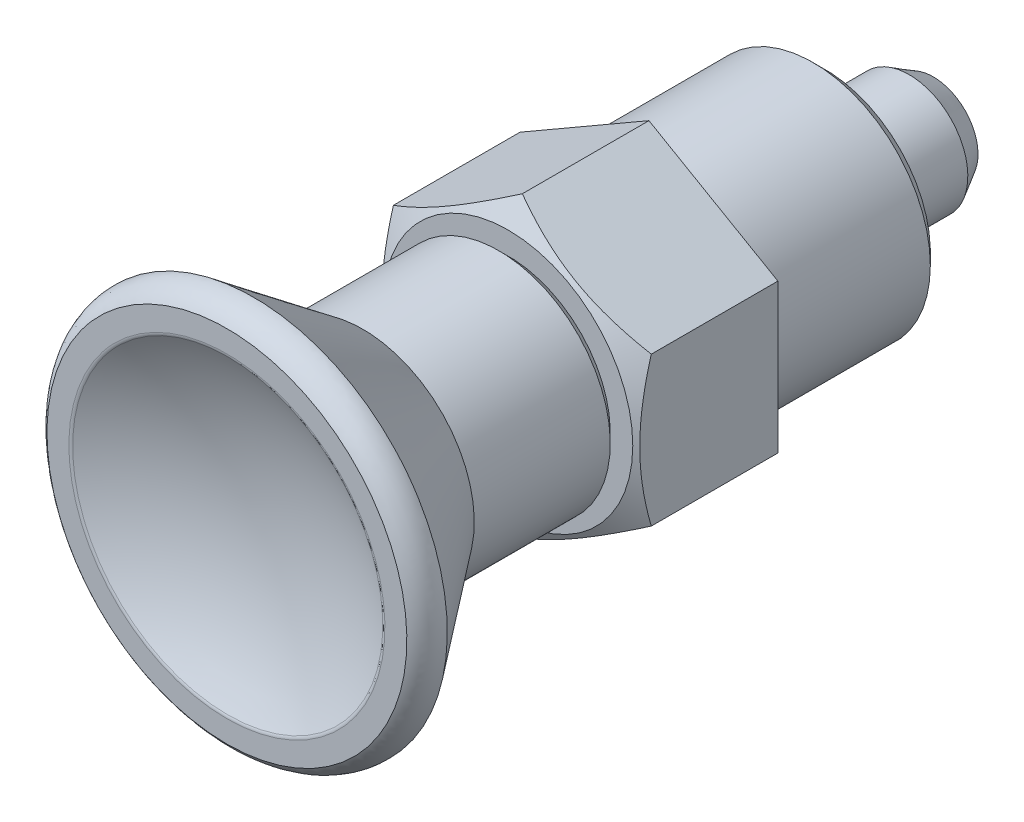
ISO-10303-21;
HEADER;
FILE_DESCRIPTION(('STEP AP214'),'2;1');
FILE_NAME('part.step','',(''),(''),'','','');
FILE_SCHEMA(('AUTOMOTIVE_DESIGN { 1 0 10303 214 1 1 1 1 }'));
ENDSEC;
DATA;
#1=APPLICATION_CONTEXT('core data for automotive mechanical design processes');
#2=APPLICATION_PROTOCOL_DEFINITION('international standard','automotive_design',2000,#1);
#3=PRODUCT_CONTEXT('',#1,'mechanical');
#4=PRODUCT('Part','Part','',(#3));
#5=PRODUCT_RELATED_PRODUCT_CATEGORY('part','',(#4));
#6=PRODUCT_DEFINITION_FORMATION('','',#4);
#7=PRODUCT_DEFINITION_CONTEXT('part definition',#1,'design');
#8=PRODUCT_DEFINITION('design','',#6,#7);
#9=PRODUCT_DEFINITION_SHAPE('','',#8);
#10=(LENGTH_UNIT() NAMED_UNIT(*) SI_UNIT(.MILLI.,.METRE.));
#11=(NAMED_UNIT(*) PLANE_ANGLE_UNIT() SI_UNIT($,.RADIAN.));
#12=(NAMED_UNIT(*) SI_UNIT($,.STERADIAN.) SOLID_ANGLE_UNIT());
#13=UNCERTAINTY_MEASURE_WITH_UNIT(LENGTH_MEASURE(1.E-05),#10,'distance_accuracy_value','');
#14=(GEOMETRIC_REPRESENTATION_CONTEXT(3) GLOBAL_UNCERTAINTY_ASSIGNED_CONTEXT((#13)) GLOBAL_UNIT_ASSIGNED_CONTEXT((#10,
#11,#12)) REPRESENTATION_CONTEXT('',''));
#15=CARTESIAN_POINT('',(0.,0.,0.));
#16=DIRECTION('',(0.,0.,1.));
#17=DIRECTION('',(1.,0.,0.));
#18=AXIS2_PLACEMENT_3D('',#15,#16,#17);
#19=CARTESIAN_POINT('',(0.,7.21644966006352E-13,58.3153369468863));
#20=DIRECTION('',(0.,0.,-1.));
#21=DIRECTION('',(0.,-1.,0.));
#22=AXIS2_PLACEMENT_3D('',#19,#20,#21);
#23=SPHERICAL_SURFACE('',#22,25.9999999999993);
#24=CARTESIAN_POINT('',(0.,0.,35.9304780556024));
#25=DIRECTION('',(0.,0.,-1.));
#26=DIRECTION('',(0.,-1.,0.));
#27=AXIS2_PLACEMENT_3D('',#24,#25,#26);
#28=CIRCLE('',#27,13.2256603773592);
#29=CARTESIAN_POINT('',(0.,-13.2256603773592,35.9304780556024));
#30=VERTEX_POINT('',#29);
#31=EDGE_CURVE('E884',#30,#30,#28,.T.);
#32=ORIENTED_EDGE('',*,*,#31,.F.);
#33=EDGE_LOOP('',(#32));
#34=FACE_BOUND('',#33,.T.);
#35=ADVANCED_FACE('F14',(#34),#23,.F.);
#36=CARTESIAN_POINT('',(0.,-13.2256603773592,35.9304780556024));
#37=CARTESIAN_POINT('',(0.,-13.3433285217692,36.0000000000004));
#38=CARTESIAN_POINT('',(0.,-13.48,36.0000000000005));
#39=CARTESIAN_POINT('',(-22.9075157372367,-13.2256603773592,35.9304780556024));
#40=CARTESIAN_POINT('',(-23.1113229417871,-13.3433285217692,36.0000000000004));
#41=CARTESIAN_POINT('',(-23.3480448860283,-13.48,36.0000000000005));
#42=CARTESIAN_POINT('',(-11.4537578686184,6.61283018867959,35.9304780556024));
#43=CARTESIAN_POINT('',(-11.5556614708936,6.6716642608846,36.0000000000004));
#44=CARTESIAN_POINT('',(-11.6740224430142,6.74,36.0000000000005));
#45=CARTESIAN_POINT('',(0.,26.4513207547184,35.9304780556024));
#46=CARTESIAN_POINT('',(0.,26.6866570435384,36.0000000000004));
#47=CARTESIAN_POINT('',(0.,26.96,36.0000000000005));
#48=CARTESIAN_POINT('',(11.4537578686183,6.6128301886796,35.9304780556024));
#49=CARTESIAN_POINT('',(11.5556614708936,6.67166426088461,36.0000000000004));
#50=CARTESIAN_POINT('',(11.6740224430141,6.74,36.0000000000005));
#51=CARTESIAN_POINT('',(22.9075157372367,-13.2256603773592,35.9304780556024));
#52=CARTESIAN_POINT('',(23.1113229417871,-13.3433285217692,36.0000000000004));
#53=CARTESIAN_POINT('',(23.3480448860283,-13.48,36.0000000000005));
#54=CARTESIAN_POINT('',(0.,-13.2256603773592,35.9304780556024));
#55=CARTESIAN_POINT('',(0.,-13.3433285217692,36.0000000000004));
#56=CARTESIAN_POINT('',(0.,-13.48,36.0000000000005));
#57=(BOUNDED_SURFACE() B_SPLINE_SURFACE(2,2,((#36,#37,#38),(#39,#40,#41),(#42,#43,#44),(#45,#46,
#47),(#48,#49,#50),(#51,#52,#53),(#54,#55,#56)),.UNSPECIFIED.,.T.,.F.,
.F.) B_SPLINE_SURFACE_WITH_KNOTS((3,2,2,3),(3,3),(0.,169.162579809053,338.325159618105,
507.487739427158),(0.,1.),
.UNSPECIFIED.) GEOMETRIC_REPRESENTATION_ITEM() RATIONAL_B_SPLINE_SURFACE(((1.,0.964612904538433,
1.),(0.5,0.482306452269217,0.5),(1.,0.964612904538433,1.),(0.5,0.482306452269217,0.5),(1.,
0.964612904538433,1.),(0.5,0.482306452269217,0.5),(1.,0.964612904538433,1.))) REPRESENTATION_ITEM('') SURFACE());
#58=CARTESIAN_POINT('',(0.,0.,36.0000000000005));
#59=DIRECTION('',(0.,0.,-1.));
#60=DIRECTION('',(0.,-1.,0.));
#61=AXIS2_PLACEMENT_3D('',#58,#59,#60);
#62=CIRCLE('',#61,13.48);
#63=CARTESIAN_POINT('',(0.,-13.48,36.0000000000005));
#64=VERTEX_POINT('',#63);
#65=EDGE_CURVE('E888',#64,#64,#62,.T.);
#66=CARTESIAN_POINT('',(0.,-13.2256603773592,35.9304780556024));
#67=CARTESIAN_POINT('',(0.,-13.2280276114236,35.9318766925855));
#68=CARTESIAN_POINT('',(0.,-13.2304063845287,35.933255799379));
#69=CARTESIAN_POINT('',(0.,-13.2351913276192,35.9359774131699));
#70=CARTESIAN_POINT('',(0.,-13.2375975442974,35.937319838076));
#71=CARTESIAN_POINT('',(0.,-13.2424365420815,35.9399672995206));
#72=CARTESIAN_POINT('',(0.,-13.2448693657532,35.9412722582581));
#73=CARTESIAN_POINT('',(0.,-13.249760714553,35.9438440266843));
#74=CARTESIAN_POINT('',(0.,-13.25221927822,35.9451107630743));
#75=CARTESIAN_POINT('',(0.,-13.257161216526,35.9476053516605));
#76=CARTESIAN_POINT('',(0.,-13.2596446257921,35.9488331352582));
#77=CARTESIAN_POINT('',(0.,-13.2646353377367,35.9512491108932));
#78=CARTESIAN_POINT('',(0.,-13.2671426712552,35.9524372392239));
#79=CARTESIAN_POINT('',(0.,-13.2721802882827,35.9547732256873));
#80=CARTESIAN_POINT('',(0.,-13.2747105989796,35.9559210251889));
#81=CARTESIAN_POINT('',(0.,-13.2797932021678,35.9581757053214));
#82=CARTESIAN_POINT('',(0.,-13.2823455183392,35.9592825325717));
#83=CARTESIAN_POINT('',(0.,-13.2874711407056,35.9614546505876));
#84=CARTESIAN_POINT('',(0.,-13.2900444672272,35.9625198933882));
#85=CARTESIAN_POINT('',(0.,-13.2952110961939,35.9646082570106));
#86=CARTESIAN_POINT('',(0.,-13.2978044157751,35.9656313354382));
#87=CARTESIAN_POINT('',(0.,-13.3030099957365,35.9676348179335));
#88=CARTESIAN_POINT('',(0.,-13.3056222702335,35.9686151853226));
#89=CARTESIAN_POINT('',(0.,-13.3108647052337,35.9705327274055));
#90=CARTESIAN_POINT('',(0.,-13.3134948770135,35.9714698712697));
#91=CARTESIAN_POINT('',(0.,-13.3187720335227,35.973300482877));
#92=CARTESIAN_POINT('',(0.,-13.3214190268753,35.9741939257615));
#93=CARTESIAN_POINT('',(0.,-13.3267287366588,35.975936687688));
#94=CARTESIAN_POINT('',(0.,-13.329391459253,35.9767859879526));
#95=CARTESIAN_POINT('',(0.,-13.3347315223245,35.9784400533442));
#96=CARTESIAN_POINT('',(0.,-13.3374088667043,35.9792448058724));
#97=CARTESIAN_POINT('',(0.,-13.3427770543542,35.9808094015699));
#98=CARTESIAN_POINT('',(0.,-13.3454678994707,35.981569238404));
#99=CARTESIAN_POINT('',(0.,-13.3508619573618,35.9830436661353));
#100=CARTESIAN_POINT('',(0.,-13.3535651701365,35.9837582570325));
#101=CARTESIAN_POINT('',(0.,-13.3589828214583,35.9851418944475));
#102=CARTESIAN_POINT('',(0.,-13.3616972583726,35.9858109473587));
#103=CARTESIAN_POINT('',(0.,-13.3671362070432,35.9871032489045));
#104=CARTESIAN_POINT('',(0.,-13.3698607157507,35.9877265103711));
#105=CARTESIAN_POINT('',(0.,-13.3753186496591,35.9889270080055));
#106=CARTESIAN_POINT('',(0.,-13.3780520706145,35.9895042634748));
#107=CARTESIAN_POINT('',(0.,-13.3835266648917,35.9906125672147));
#108=CARTESIAN_POINT('',(0.,-13.3862678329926,35.9911436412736));
#109=CARTESIAN_POINT('',(0.,-13.3917567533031,35.9921594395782));
#110=CARTESIAN_POINT('',(0.,-13.394504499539,35.9926441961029));
#111=CARTESIAN_POINT('',(0.,-13.4000054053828,35.9935672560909));
#112=CARTESIAN_POINT('',(0.,-13.4027585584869,35.9940055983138));
#113=CARTESIAN_POINT('',(0.,-13.4082691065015,35.9948357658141));
#114=CARTESIAN_POINT('',(0.,-13.4110264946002,35.9952276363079));
#115=CARTESIAN_POINT('',(0.,-13.4165443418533,35.9959648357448));
#116=CARTESIAN_POINT('',(0.,-13.4193047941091,35.9963102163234));
#117=CARTESIAN_POINT('',(0.,-13.4248276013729,35.9969544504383));
#118=CARTESIAN_POINT('',(0.,-13.4275899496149,35.9972533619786));
#119=CARTESIAN_POINT('',(0.,-13.4331153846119,35.9978047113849));
#120=CARTESIAN_POINT('',(0.,-13.43587846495,35.9980572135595));
#121=CARTESIAN_POINT('',(0.,-13.4414042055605,35.9985158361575));
#122=CARTESIAN_POINT('',(0.,-13.4441668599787,35.998722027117));
#123=CARTESIAN_POINT('',(0.,-13.4496905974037,35.9990881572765));
#124=CARTESIAN_POINT('',(0.,-13.4524516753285,35.9992481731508));
#125=CARTESIAN_POINT('',(0.,-13.4579711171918,35.9995221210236));
#126=CARTESIAN_POINT('',(0.,-13.4607294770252,35.9996361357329));
#127=CARTESIAN_POINT('',(0.,-13.466242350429,35.9998182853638));
#128=CARTESIAN_POINT('',(0.,-13.4689968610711,35.9998865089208));
#129=CARTESIAN_POINT('',(0.,-13.4745009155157,35.9999773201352));
#130=CARTESIAN_POINT('',(0.,-13.4772504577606,36.0000000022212));
#131=CARTESIAN_POINT('',(0.,-13.48,36.0000000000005));
#132=B_SPLINE_CURVE_WITH_KNOTS('',3,(#66,#67,#68,#69,#70,#71,#72,#73,#74,#75,#76,#77,#78,#79,
#80,#81,#82,#83,#84,#85,#86,#87,#88,#89,#90,#91,#92,#93,#94,#95,#96,#97,#98,#99,#100,#101,#102,
#103,#104,#105,#106,#107,#108,#109,#110,#111,#112,#113,#114,#115,#116,#117,#118,#119,#120,#121,
#122,#123,#124,#125,#126,#127,#128,#129,#130,#131),.UNSPECIFIED.,.F.,.F.,(4,2,2,2,2,2,2,2,2,2,2,
2,2,2,2,2,2,2,2,2,2,2,2,2,2,2,2,2,2,2,2,2,4),(0.,0.00824853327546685,0.0165142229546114,
0.0247959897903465,0.0330927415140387,0.0414033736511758,0.0497267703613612,0.0580618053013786,
0.0664073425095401,0.0747622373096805,0.0831253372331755,0.0914954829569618,0.0998715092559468,
0.108252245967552,0.116636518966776,0.125023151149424,0.133410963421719,0.141798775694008,
0.150185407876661,0.158569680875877,0.166950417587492,0.175326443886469,0.18369658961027,
0.192059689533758,0.200414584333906,0.208760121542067,0.217095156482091,0.22541855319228,
0.233729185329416,0.242025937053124,0.250307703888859,0.258573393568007,0.266821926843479),.UNSPECIFIED.);
#133=EDGE_CURVE('BSEAM118',#30,#64,#132,.T.);
#134=ORIENTED_EDGE('',*,*,#31,.T.);
#135=ORIENTED_EDGE('',*,*,#65,.F.);
#136=ORIENTED_EDGE('',*,*,#133,.T.);
#137=ORIENTED_EDGE('',*,*,#133,.F.);
#138=EDGE_LOOP('',(#134,#136,#135,#137));
#139=FACE_BOUND('',#138,.T.);
#140=ADVANCED_FACE('F118',(#139),#57,.T.);
#141=CARTESIAN_POINT('',(-16.885,16.885,36.0000000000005));
#142=DIRECTION('',(0.,0.,1.));
#143=DIRECTION('',(0.,-1.,0.));
#144=AXIS2_PLACEMENT_3D('',#141,#142,#143);
#145=PLANE('',#144);
#146=CARTESIAN_POINT('',(0.,0.,36.0000000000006));
#147=DIRECTION('',(0.,0.,-1.));
#148=DIRECTION('',(0.,-1.,0.));
#149=AXIS2_PLACEMENT_3D('',#146,#147,#148);
#150=CIRCLE('',#149,15.35);
#151=CARTESIAN_POINT('',(0.,-15.35,36.0000000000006));
#152=VERTEX_POINT('',#151);
#153=EDGE_CURVE('E898',#152,#152,#150,.T.);
#154=ORIENTED_EDGE('',*,*,#153,.F.);
#155=EDGE_LOOP('',(#154));
#156=FACE_BOUND('',#155,.T.);
#157=ORIENTED_EDGE('',*,*,#65,.T.);
#158=EDGE_LOOP('',(#157));
#159=FACE_BOUND('',#158,.T.);
#160=ADVANCED_FACE('F120',(#156,#159),#145,.T.);
#161=CARTESIAN_POINT('',(0.,-15.35,36.0000000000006));
#162=CARTESIAN_POINT('',(0.,-16.615654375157,35.1898669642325));
#163=CARTESIAN_POINT('',(0.,-16.5,33.7000000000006));
#164=CARTESIAN_POINT('',(-26.5869798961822,-15.35,36.0000000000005));
#165=CARTESIAN_POINT('',(-28.779157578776,-16.615654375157,35.1898669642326));
#166=CARTESIAN_POINT('',(-28.5788383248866,-16.5,33.7000000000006));
#167=CARTESIAN_POINT('',(-13.2934899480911,7.675,36.0000000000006));
#168=CARTESIAN_POINT('',(-14.389578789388,8.30782718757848,35.1898669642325));
#169=CARTESIAN_POINT('',(-14.2894191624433,8.25,33.7000000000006));
#170=CARTESIAN_POINT('',(0.,30.7,36.0000000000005));
#171=CARTESIAN_POINT('',(0.,33.2313087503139,35.1898669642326));
#172=CARTESIAN_POINT('',(0.,33.,33.7000000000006));
#173=CARTESIAN_POINT('',(13.2934899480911,7.675,36.0000000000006));
#174=CARTESIAN_POINT('',(14.389578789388,8.30782718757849,35.1898669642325));
#175=CARTESIAN_POINT('',(14.2894191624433,8.25,33.7000000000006));
#176=CARTESIAN_POINT('',(26.5869798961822,-15.35,36.0000000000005));
#177=CARTESIAN_POINT('',(28.779157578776,-16.6156543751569,35.1898669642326));
#178=CARTESIAN_POINT('',(28.5788383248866,-16.5,33.7000000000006));
#179=CARTESIAN_POINT('',(0.,-15.35,36.0000000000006));
#180=CARTESIAN_POINT('',(0.,-16.615654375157,35.1898669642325));
#181=CARTESIAN_POINT('',(0.,-16.5,33.7000000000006));
#182=(BOUNDED_SURFACE() B_SPLINE_SURFACE(2,2,((#161,#162,#163),(#164,#165,#166),(#167,#168,
#169),(#170,#171,#172),(#173,#174,#175),(#176,#177,#178),(#179,#180,#181)),.UNSPECIFIED.,.T.,
.F.,.F.) B_SPLINE_SURFACE_WITH_KNOTS((3,2,2,3),(3,3),(0.,18.7749492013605,37.5498984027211,
56.3248476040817),(0.,1.),
.UNSPECIFIED.) GEOMETRIC_REPRESENTATION_ITEM() RATIONAL_B_SPLINE_SURFACE(((1.,0.857079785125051,
1.),(0.5,0.428539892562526,0.5),(1.,0.857079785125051,1.),(0.5,0.428539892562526,0.5),(1.,
0.857079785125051,1.),(0.5,0.428539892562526,0.5),(1.,0.857079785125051,1.))) REPRESENTATION_ITEM('') SURFACE());
#183=CARTESIAN_POINT('',(0.,0.,33.7000000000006));
#184=DIRECTION('',(0.,0.,1.));
#185=DIRECTION('',(0.,-1.,0.));
#186=AXIS2_PLACEMENT_3D('',#183,#184,#185);
#187=CIRCLE('',#186,16.5);
#188=CARTESIAN_POINT('',(0.,-16.5,33.7000000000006));
#189=VERTEX_POINT('',#188);
#190=EDGE_CURVE('E895',#189,#189,#187,.T.);
#191=CARTESIAN_POINT('',(0.,-15.35,36.0000000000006));
#192=CARTESIAN_POINT('',(0.,-15.3556561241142,35.9963795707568));
#193=CARTESIAN_POINT('',(0.,-15.3612977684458,35.9927365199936));
#194=CARTESIAN_POINT('',(0.,-15.3725641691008,35.9853973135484));
#195=CARTESIAN_POINT('',(0.,-15.3781888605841,35.9817010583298));
#196=CARTESIAN_POINT('',(0.,-15.3894206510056,35.974255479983));
#197=CARTESIAN_POINT('',(0.,-15.395027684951,35.9705060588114));
#198=CARTESIAN_POINT('',(0.,-15.4062234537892,35.9629541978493));
#199=CARTESIAN_POINT('',(0.,-15.4118121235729,35.9591516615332));
#200=CARTESIAN_POINT('',(0.,-15.4229704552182,35.9514936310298));
#201=CARTESIAN_POINT('',(0.,-15.4285400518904,35.9476380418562));
#202=CARTESIAN_POINT('',(0.,-15.4396595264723,35.9398739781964));
#203=CARTESIAN_POINT('',(0.,-15.4452093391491,35.9359654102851));
#204=CARTESIAN_POINT('',(0.,-15.4562885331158,35.9280954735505));
#205=CARTESIAN_POINT('',(0.,-15.4618178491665,35.9241340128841));
#206=CARTESIAN_POINT('',(0.,-15.4728553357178,35.9161583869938));
#207=CARTESIAN_POINT('',(0.,-15.4783634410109,35.9121441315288));
#208=CARTESIAN_POINT('',(0.,-15.489357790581,35.9040630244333));
#209=CARTESIAN_POINT('',(0.,-15.4948439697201,35.8999960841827));
#210=CARTESIAN_POINT('',(0.,-15.5057937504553,35.8918097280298));
#211=CARTESIAN_POINT('',(0.,-15.5112572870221,35.8876902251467));
#212=CARTESIAN_POINT('',(0.,-15.5221610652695,35.8793988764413));
#213=CARTESIAN_POINT('',(0.,-15.527601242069,35.8752269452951));
#214=CARTESIAN_POINT('',(0.,-15.538457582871,35.8668308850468));
#215=CARTESIAN_POINT('',(0.,-15.5438736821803,35.8626066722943));
#216=CARTESIAN_POINT('',(0.,-15.5546811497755,35.8541062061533));
#217=CARTESIAN_POINT('',(0.,-15.5600724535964,35.849829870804));
#218=CARTESIAN_POINT('',(0.,-15.5708296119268,35.8412253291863));
#219=CARTESIAN_POINT('',(0.,-15.5761954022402,35.8368970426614));
#220=CARTESIAN_POINT('',(0.,-15.5869008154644,35.8281887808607));
#221=CARTESIAN_POINT('',(0.,-15.592240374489,35.8238087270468));
#222=CARTESIAN_POINT('',(0.,-15.6028926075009,35.8149971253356));
#223=CARTESIAN_POINT('',(0.,-15.6082052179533,35.8105655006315));
#224=CARTESIAN_POINT('',(0.,-15.6188028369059,35.8016509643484));
#225=CARTESIAN_POINT('',(0.,-15.6240877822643,35.7971679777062));
#226=CARTESIAN_POINT('',(0.,-15.634629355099,35.7881509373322));
#227=CARTESIAN_POINT('',(0.,-15.6398859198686,35.7836168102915));
#228=CARTESIAN_POINT('',(0.,-15.6503700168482,35.7744977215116));
#229=CARTESIAN_POINT('',(0.,-15.655597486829,35.7699126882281));
#230=CARTESIAN_POINT('',(0.,-15.6660226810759,35.7606920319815));
#231=CARTESIAN_POINT('',(0.,-15.6712203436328,35.7560563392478));
#232=CARTESIAN_POINT('',(0.,-15.6815852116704,35.7467346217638));
#233=CARTESIAN_POINT('',(0.,-15.6867523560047,35.7420485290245));
#234=CARTESIAN_POINT('',(0.,-15.6970554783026,35.7326262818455));
#235=CARTESIAN_POINT('',(0.,-15.7021913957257,35.7278900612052));
#236=CARTESIAN_POINT('',(0.,-15.7124313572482,35.7183678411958));
#237=CARTESIAN_POINT('',(0.,-15.717535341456,35.7135817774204));
#238=CARTESIAN_POINT('',(0.,-15.7277107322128,35.7039601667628));
#239=CARTESIAN_POINT('',(0.,-15.7327820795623,35.6991245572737));
#240=CARTESIAN_POINT('',(0.,-15.7428914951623,35.6894041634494));
#241=CARTESIAN_POINT('',(0.,-15.7479295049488,35.6845193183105));
#242=CARTESIAN_POINT('',(0.,-15.7579715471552,35.674700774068));
#243=CARTESIAN_POINT('',(0.,-15.7629755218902,35.6697670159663));
#244=CARTESIAN_POINT('',(0.,-15.7729487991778,35.6598509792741));
#245=CARTESIAN_POINT('',(0.,-15.7779180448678,35.6548686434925));
#246=CARTESIAN_POINT('',(0.,-15.7878211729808,35.6448557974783));
#247=CARTESIAN_POINT('',(0.,-15.7927549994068,35.639825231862));
#248=CARTESIAN_POINT('',(0.,-15.8025866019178,35.6297162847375));
#249=CARTESIAN_POINT('',(0.,-15.8074843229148,35.6246378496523));
#250=CARTESIAN_POINT('',(0.,-15.817243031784,35.6144335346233));
#251=CARTESIAN_POINT('',(0.,-15.8221039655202,35.6093076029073));
#252=CARTESIAN_POINT('',(0.,-15.8317884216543,35.5990086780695));
#253=CARTESIAN_POINT('',(0.,-15.8366118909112,35.5938356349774));
#254=CARTESIAN_POINT('',(0.,-15.8462207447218,35.5834428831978));
#255=CARTESIAN_POINT('',(0.,-15.8510060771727,35.5782231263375));
#256=CARTESIAN_POINT('',(0.,-15.8605379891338,35.5677373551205));
#257=CARTESIAN_POINT('',(0.,-15.8652845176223,35.5624712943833));
#258=CARTESIAN_POINT('',(0.,-15.8747381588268,35.551893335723));
#259=CARTESIAN_POINT('',(0.,-15.8794452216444,35.5465813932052));
#260=CARTESIAN_POINT('',(0.,-15.8888192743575,35.5359121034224));
#261=CARTESIAN_POINT('',(0.,-15.8934862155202,35.5305547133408));
#262=CARTESIAN_POINT('',(0.,-15.9027793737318,35.5197949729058));
#263=CARTESIAN_POINT('',(0.,-15.9074055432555,35.514392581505));
#264=CARTESIAN_POINT('',(0.,-15.9166165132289,35.5035432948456));
#265=CARTESIAN_POINT('',(0.,-15.9212012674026,35.4980963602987));
#266=CARTESIAN_POINT('',(0.,-15.9303287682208,35.4871584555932));
#267=CARTESIAN_POINT('',(0.,-15.9348714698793,35.4816674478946));
#268=CARTESIAN_POINT('',(0.,-15.9439142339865,35.4706418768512));
#269=CARTESIAN_POINT('',(0.,-15.9484142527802,35.4651072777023));
#270=CARTESIAN_POINT('',(0.,-15.9573710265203,35.4539950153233));
#271=CARTESIAN_POINT('',(0.,-15.9618277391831,35.4484173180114));
#272=CARTESIAN_POINT('',(0.,-15.9706972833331,35.437219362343));
#273=CARTESIAN_POINT('',(0.,-15.9751100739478,35.4315990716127));
#274=CARTESIAN_POINT('',(0.,-15.9838911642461,35.420316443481));
#275=CARTESIAN_POINT('',(0.,-15.9882594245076,35.414654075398));
#276=CARTESIAN_POINT('',(0.,-15.9969508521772,35.4032878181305));
#277=CARTESIAN_POINT('',(0.,-16.0012739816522,35.3975838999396));
#278=CARTESIAN_POINT('',(0.,-16.0098745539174,35.3861350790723));
#279=CARTESIAN_POINT('',(0.,-16.0141519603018,35.3803901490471));
#280=CARTESIAN_POINT('',(0.,-16.0226605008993,35.3688598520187));
#281=CARTESIAN_POINT('',(0.,-16.0268916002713,35.3630744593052));
#282=CARTESIAN_POINT('',(0.,-16.035306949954,35.3514637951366));
#283=CARTESIAN_POINT('',(0.,-16.039491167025,35.3456384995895));
#284=CARTESIAN_POINT('',(0.,-16.0478121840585,35.33394859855));
#285=CARTESIAN_POINT('',(0.,-16.0519489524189,35.3280839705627));
#286=CARTESIAN_POINT('',(0.,-16.0601745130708,35.316315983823));
#287=CARTESIAN_POINT('',(0.,-16.0642632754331,35.3104126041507));
#288=CARTESIAN_POINT('',(0.,-16.072392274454,35.2985677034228));
#289=CARTESIAN_POINT('',(0.,-16.0764324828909,35.292626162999));
#290=CARTESIAN_POINT('',(0.,-16.0844638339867,35.2807055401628));
#291=CARTESIAN_POINT('',(0.,-16.0884549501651,35.2747264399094));
#292=CARTESIAN_POINT('',(0.,-16.0963875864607,35.2627313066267));
#293=CARTESIAN_POINT('',(0.,-16.1003290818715,35.2567152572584));
#294=CARTESIAN_POINT('',(0.,-16.1081619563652,35.2446468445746));
#295=CARTESIAN_POINT('',(0.,-16.1120533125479,35.238594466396));
#296=CARTESIAN_POINT('',(0.,-16.1197853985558,35.2264540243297));
#297=CARTESIAN_POINT('',(0.,-16.1236261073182,35.2203659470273));
#298=CARTESIAN_POINT('',(0.,-16.131256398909,35.2081547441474));
#299=CARTESIAN_POINT('',(0.,-16.1350459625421,35.2020316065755));
#300=CARTESIAN_POINT('',(0.,-16.1425734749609,35.1897509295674));
#301=CARTESIAN_POINT('',(0.,-16.1463114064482,35.183593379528));
#302=CARTESIAN_POINT('',(0.,-16.15373517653,35.1712445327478));
#303=CARTESIAN_POINT('',(0.,-16.1574209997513,35.1650532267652));
#304=CARTESIAN_POINT('',(0.,-16.1647400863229,35.1526375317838));
#305=CARTESIAN_POINT('',(0.,-16.1683733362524,35.1464131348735));
#306=CARTESIAN_POINT('',(0.,-16.175586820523,35.1339319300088));
#307=CARTESIAN_POINT('',(0.,-16.179167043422,35.1276751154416));
#308=CARTESIAN_POINT('',(0.,-16.1862740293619,35.1151297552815));
#309=CARTESIAN_POINT('',(0.,-16.1898007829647,35.1088412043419));
#310=CARTESIAN_POINT('',(0.,-16.196800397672,35.0962330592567));
#311=CARTESIAN_POINT('',(0.,-16.2002732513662,35.0899134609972));
#312=CARTESIAN_POINT('',(0.,-16.2071646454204,35.0772439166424));
#313=CARTESIAN_POINT('',(0.,-16.210583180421,35.0708939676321));
#314=CARTESIAN_POINT('',(0.,-16.2173655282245,35.0581644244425));
#315=CARTESIAN_POINT('',(0.,-16.2207293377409,35.0517848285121));
#316=CARTESIAN_POINT('',(0.,-16.2274018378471,35.0389967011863));
#317=CARTESIAN_POINT('',(0.,-16.2307105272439,35.0325881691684));
#318=CARTESIAN_POINT('',(0.,-16.237272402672,35.0197428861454));
#319=CARTESIAN_POINT('',(0.,-16.2405255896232,35.0133061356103));
#320=CARTESIAN_POINT('',(0.,-16.2469760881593,35.000405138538));
#321=CARTESIAN_POINT('',(0.,-16.2501734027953,34.9939408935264));
#322=CARTESIAN_POINT('',(0.,-16.2565117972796,34.9809856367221));
#323=CARTESIAN_POINT('',(0.,-16.2596528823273,34.9744946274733));
#324=CARTESIAN_POINT('',(0.,-16.2658784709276,34.9614865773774));
#325=CARTESIAN_POINT('',(0.,-16.2689629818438,34.9549695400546));
#326=CARTESIAN_POINT('',(0.,-16.275075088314,34.9419101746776));
#327=CARTESIAN_POINT('',(0.,-16.2781026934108,34.9353678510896));
#328=CARTESIAN_POINT('',(0.,-16.2841006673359,34.9222586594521));
#329=CARTESIAN_POINT('',(0.,-16.2870710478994,34.9156917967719));
#330=CARTESIAN_POINT('',(0.,-16.2929542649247,34.9025342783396));
#331=CARTESIAN_POINT('',(0.,-16.2958671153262,34.8959436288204));
#332=CARTESIAN_POINT('',(0.,-16.3016349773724,34.882739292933));
#333=CARTESIAN_POINT('',(0.,-16.3044900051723,34.8761256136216));
#334=CARTESIAN_POINT('',(0.,-16.3101419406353,34.862875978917));
#335=CARTESIAN_POINT('',(0.,-16.3129388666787,34.8562400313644));
#336=CARTESIAN_POINT('',(0.,-16.3184743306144,34.8429466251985));
#337=CARTESIAN_POINT('',(0.,-16.3212128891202,34.8362891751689));
#338=CARTESIAN_POINT('',(0.,-16.3266313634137,34.822953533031));
#339=CARTESIAN_POINT('',(0.,-16.3293113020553,34.8162753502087));
#340=CARTESIAN_POINT('',(0.,-16.3346122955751,34.8028990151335));
#341=CARTESIAN_POINT('',(0.,-16.3372333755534,34.7962008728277));
#342=CARTESIAN_POINT('',(0.,-16.3424164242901,34.7827853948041));
#343=CARTESIAN_POINT('',(0.,-16.3449784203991,34.7760680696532));
#344=CARTESIAN_POINT('',(0.,-16.3500430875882,34.7626150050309));
#345=CARTESIAN_POINT('',(0.,-16.3525457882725,34.7558792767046));
#346=CARTESIAN_POINT('',(0.,-16.357491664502,34.7423901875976));
#347=CARTESIAN_POINT('',(0.,-16.3599348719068,34.7356368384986));
#348=CARTESIAN_POINT('',(0.,-16.364761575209,34.722113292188));
#349=CARTESIAN_POINT('',(0.,-16.367145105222,34.7153431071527));
#350=CARTESIAN_POINT('',(0.,-16.3718522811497,34.7017866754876));
#351=CARTESIAN_POINT('',(0.,-16.3741759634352,34.6950004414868));
#352=CARTESIAN_POINT('',(0.,-16.3787632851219,34.6814127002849));
#353=CARTESIAN_POINT('',(0.,-16.3810269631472,34.6746112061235));
#354=CARTESIAN_POINT('',(0.,-16.3854941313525,34.6609937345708));
#355=CARTESIAN_POINT('',(0.,-16.3876976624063,34.654177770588));
#356=CARTESIAN_POINT('',(0.,-16.3920444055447,34.6405321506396));
#357=CARTESIAN_POINT('',(0.,-16.3941876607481,34.6337025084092));
#358=CARTESIAN_POINT('',(0.,-16.3984137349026,34.62003032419));
#359=CARTESIAN_POINT('',(0.,-16.4004965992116,34.6131877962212));
#360=CARTESIAN_POINT('',(0.,-16.404601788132,34.5994906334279));
#361=CARTESIAN_POINT('',(0.,-16.4066241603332,34.5926360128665));
#362=CARTESIAN_POINT('',(0.,-16.4106082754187,34.5789154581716));
#363=CARTESIAN_POINT('',(0.,-16.4125700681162,34.5720495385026));
#364=CARTESIAN_POINT('',(0.,-16.4164329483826,34.55830717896));
#365=CARTESIAN_POINT('',(0.,-16.4183340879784,34.5514307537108));
#366=CARTESIAN_POINT('',(0.,-16.4220756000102,34.5376681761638));
#367=CARTESIAN_POINT('',(0.,-16.4239160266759,34.5307820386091));
#368=CARTESIAN_POINT('',(0.,-16.4275360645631,34.5170008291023));
#369=CARTESIAN_POINT('',(0.,-16.429315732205,34.5101057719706));
#370=CARTESIAN_POINT('',(0.,-16.4328142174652,34.4963075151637));
#371=CARTESIAN_POINT('',(0.,-16.4345330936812,34.4894043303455));
#372=CARTESIAN_POINT('',(0.,-16.4379099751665,34.4755906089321));
#373=CARTESIAN_POINT('',(0.,-16.4395680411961,34.4686800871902));
#374=CARTESIAN_POINT('',(0.,-16.4428232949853,34.4548524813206));
#375=CARTESIAN_POINT('',(0.,-16.4444205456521,34.4479354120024));
#376=CARTESIAN_POINT('',(0.,-16.4475541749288,34.4340954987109));
#377=CARTESIAN_POINT('',(0.,-16.4490906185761,34.4271726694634));
#378=CARTESIAN_POINT('',(0.,-16.4521026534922,34.4133220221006));
#379=CARTESIAN_POINT('',(0.,-16.4535783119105,34.406394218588));
#380=CARTESIAN_POINT('',(0.,-16.4564688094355,34.3925344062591));
#381=CARTESIAN_POINT('',(0.,-16.4578837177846,34.3856024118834));
#382=CARTESIAN_POINT('',(0.,-16.4606527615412,34.3717349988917));
#383=CARTESIAN_POINT('',(0.,-16.4620069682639,34.3647995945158));
#384=CARTESIAN_POINT('',(0.,-16.46465466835,34.3509261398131));
#385=CARTESIAN_POINT('',(0.,-16.4659482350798,34.3439881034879));
#386=CARTESIAN_POINT('',(0.,-16.4684747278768,34.3301101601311));
#387=CARTESIAN_POINT('',(0.,-16.4697077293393,34.3231702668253));
#388=CARTESIAN_POINT('',(0.,-16.4721131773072,34.3092893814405));
#389=CARTESIAN_POINT('',(0.,-16.4732857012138,34.3023484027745));
#390=CARTESIAN_POINT('',(0.,-16.4755702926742,34.288466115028));
#391=CARTESIAN_POINT('',(0.,-16.4766824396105,34.2815248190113));
#392=CARTESIAN_POINT('',(0.,-16.4788463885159,34.2676426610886));
#393=CARTESIAN_POINT('',(0.,-16.4798982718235,34.2607018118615));
#394=CARTESIAN_POINT('',(0.,-16.4819418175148,34.2468213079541));
#395=CARTESIAN_POINT('',(0.,-16.4829335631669,34.2398816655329));
#396=CARTESIAN_POINT('',(0.,-16.4848569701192,34.2260043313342));
#397=CARTESIAN_POINT('',(0.,-16.4857887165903,34.2190666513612));
#398=CARTESIAN_POINT('',(0.,-16.487592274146,34.2051939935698));
#399=CARTESIAN_POINT('',(0.,-16.4884641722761,34.1982590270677));
#400=CARTESIAN_POINT('',(0.,-16.4901481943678,34.184392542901));
#401=CARTESIAN_POINT('',(0.,-16.4909604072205,34.1774610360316));
#402=CARTESIAN_POINT('',(0.,-16.4925252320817,34.1636022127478));
#403=CARTESIAN_POINT('',(0.,-16.4932779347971,34.1566749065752));
#404=CARTESIAN_POINT('',(0.,-16.4947239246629,34.1428252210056));
#405=CARTESIAN_POINT('',(0.,-16.4954173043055,34.1359028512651));
#406=CARTESIAN_POINT('',(0.,-16.4967448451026,34.1220637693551));
#407=CARTESIAN_POINT('',(0.,-16.4973791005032,34.1151470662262));
#408=CARTESIAN_POINT('',(0.,-16.4985886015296,34.1013200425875));
#409=CARTESIAN_POINT('',(0.,-16.4991639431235,34.0944097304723));
#410=CARTESIAN_POINT('',(0.,-16.5002558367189,34.0805962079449));
#411=CARTESIAN_POINT('',(0.,-16.5007724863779,34.0736930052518));
#412=CARTESIAN_POINT('',(0.,-16.5017472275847,34.059894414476));
#413=CARTESIAN_POINT('',(0.,-16.5022054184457,34.0529990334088));
#414=CARTESIAN_POINT('',(0.,-16.5030634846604,34.039216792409));
#415=CARTESIAN_POINT('',(0.,-16.503463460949,34.0323299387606));
#416=CARTESIAN_POINT('',(0.,-16.5042053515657,34.0185654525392));
#417=CARTESIAN_POINT('',(0.,-16.5045473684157,34.011687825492));
#418=CARTESIAN_POINT('',(0.,-16.5051736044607,33.9979424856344));
#419=CARTESIAN_POINT('',(0.,-16.5054579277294,33.9910747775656));
#420=CARTESIAN_POINT('',(0.,-16.5059690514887,33.977349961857));
#421=CARTESIAN_POINT('',(0.,-16.5061959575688,33.9704928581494));
#422=CARTESIAN_POINT('',(0.,-16.5065925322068,33.9567899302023));
#423=CARTESIAN_POINT('',(0.,-16.506762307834,33.9499441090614));
#424=CARTESIAN_POINT('',(0.,-16.5070449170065,33.9362644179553));
#425=CARTESIAN_POINT('',(0.,-16.507157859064,33.9294305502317));
#426=CARTESIAN_POINT('',(0.,-16.5073271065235,33.9157754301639));
#427=CARTESIAN_POINT('',(0.,-16.5073835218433,33.9089541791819));
#428=CARTESIAN_POINT('',(0.,-16.5074400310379,33.8953249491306));
#429=CARTESIAN_POINT('',(0.,-16.5074402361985,33.8885169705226));
#430=CARTESIAN_POINT('',(0.,-16.5073846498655,33.8749149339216));
#431=CARTESIAN_POINT('',(0.,-16.5073289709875,33.8681208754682));
#432=CARTESIAN_POINT('',(0.,-16.5071619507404,33.8545473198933));
#433=CARTESIAN_POINT('',(0.,-16.5070507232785,33.84776782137));
#434=CARTESIAN_POINT('',(0.,-16.5067729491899,33.8342240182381));
#435=CARTESIAN_POINT('',(0.,-16.5066065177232,33.8274597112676));
#436=CARTESIAN_POINT('',(0.,-16.5062186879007,33.8139469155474));
#437=CARTESIAN_POINT('',(0.,-16.5059974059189,33.8071984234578));
#438=CARTESIAN_POINT('',(0.,-16.5055002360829,33.7937178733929));
#439=CARTESIAN_POINT('',(0.,-16.5052244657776,33.7869858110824));
#440=CARTESIAN_POINT('',(0.,-16.5046186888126,33.7735387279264));
#441=CARTESIAN_POINT('',(0.,-16.5042888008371,33.7668237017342));
#442=CARTESIAN_POINT('',(0.,-16.503575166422,33.7534112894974));
#443=CARTESIAN_POINT('',(0.,-16.503191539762,33.7467138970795));
#444=CARTESIAN_POINT('',(0.,-16.5023708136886,33.7333373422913));
#445=CARTESIAN_POINT('',(0.,-16.5019338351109,33.726658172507));
#446=CARTESIAN_POINT('',(0.,-16.5010067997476,33.7133186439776));
#447=CARTESIAN_POINT('',(0.,-16.5005168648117,33.7066582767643));
#448=CARTESIAN_POINT('',(0.,-16.5,33.7000000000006));
#449=B_SPLINE_CURVE_WITH_KNOTS('',3,(#191,#192,#193,#194,#195,#196,#197,#198,#199,#200,#201,
#202,#203,#204,#205,#206,#207,#208,#209,#210,#211,#212,#213,#214,#215,#216,#217,#218,#219,#220,
#221,#222,#223,#224,#225,#226,#227,#228,#229,#230,#231,#232,#233,#234,#235,#236,#237,#238,#239,
#240,#241,#242,#243,#244,#245,#246,#247,#248,#249,#250,#251,#252,#253,#254,#255,#256,#257,#258,
#259,#260,#261,#262,#263,#264,#265,#266,#267,#268,#269,#270,#271,#272,#273,#274,#275,#276,#277,
#278,#279,#280,#281,#282,#283,#284,#285,#286,#287,#288,#289,#290,#291,#292,#293,#294,#295,#296,
#297,#298,#299,#300,#301,#302,#303,#304,#305,#306,#307,#308,#309,#310,#311,#312,#313,#314,#315,
#316,#317,#318,#319,#320,#321,#322,#323,#324,#325,#326,#327,#328,#329,#330,#331,#332,#333,#334,
#335,#336,#337,#338,#339,#340,#341,#342,#343,#344,#345,#346,#347,#348,#349,#350,#351,#352,#353,
#354,#355,#356,#357,#358,#359,#360,#361,#362,#363,#364,#365,#366,#367,#368,#369,#370,#371,#372,
#373,#374,#375,#376,#377,#378,#379,#380,#381,#382,#383,#384,#385,#386,#387,#388,#389,#390,#391,
#392,#393,#394,#395,#396,#397,#398,#399,#400,#401,#402,#403,#404,#405,#406,#407,#408,#409,#410,
#411,#412,#413,#414,#415,#416,#417,#418,#419,#420,#421,#422,#423,#424,#425,#426,#427,#428,#429,
#430,#431,#432,#433,#434,#435,#436,#437,#438,#439,#440,#441,#442,#443,#444,#445,#446,#447,#448),
.UNSPECIFIED.,.F.,.F.,(4,2,2,2,2,2,2,2,2,2,2,2,2,2,2,2,2,2,2,2,2,2,2,2,2,2,2,2,2,2,2,2,2,2,2,2,
2,2,2,2,2,2,2,2,2,2,2,2,2,2,2,2,2,2,2,2,2,2,2,2,2,2,2,2,2,2,2,2,2,2,2,2,2,2,2,2,2,2,2,2,2,2,2,2,
2,2,2,2,2,2,2,2,2,2,2,2,2,2,2,2,2,2,2,2,2,2,2,2,2,2,2,2,2,2,2,2,2,2,2,2,2,2,2,2,2,2,2,2,4),(0.,
0.0201467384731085,0.0403379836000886,0.0605732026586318,0.0808518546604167,0.101173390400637,
0.121537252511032,0.141942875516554,0.162389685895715,0.182877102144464,0.20340453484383,
0.223971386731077,0.24457705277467,0.265220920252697,0.285902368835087,0.306620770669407,
0.327375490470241,0.348165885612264,0.368991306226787,0.389851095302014,0.41074458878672,
0.431671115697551,0.452629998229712,0.473620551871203,0.49464208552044,0.515693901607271,
0.536775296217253,0.557885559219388,0.579023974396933,0.600189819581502,0.621382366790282,
0.642600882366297,0.663844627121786,0.685112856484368,0.706404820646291,0.727719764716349,
0.749056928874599,0.770415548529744,0.791794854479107,0.813194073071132,0.834612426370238,
0.856049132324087,0.877503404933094,0.89897445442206,0.920461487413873,0.941963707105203,
0.963480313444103,0.985010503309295,1.00655347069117,1.02810840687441,1.049674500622,
1.07125093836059,1.09283690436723,1.11443158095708,1.13603414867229,1.15764378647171,
1.17925967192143,1.20088098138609,1.22250689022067,1.24413657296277,1.26576920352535,
1.28740395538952,1.30904000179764,1.33067651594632,1.35231267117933,1.37394764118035,
1.39558060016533,1.41721072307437,1.43883718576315,1.46045916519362,1.48207583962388,
1.50368638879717,1.52528999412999,1.54688583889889,1.56847310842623,1.59005099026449,
1.61161867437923,1.63317535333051,1.65472022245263,1.6762524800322,1.69777132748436,
1.71927596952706,1.74076561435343,1.76223947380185,1.78369676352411,1.805136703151,
1.82655851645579,1.84796143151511,1.86934468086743,1.89070750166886,1.91204913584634,
1.93336883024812,1.95466583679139,1.97593941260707,1.99718882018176,2.01841332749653,
2.03961220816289,2.0607847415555,2.08193021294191,2.10304791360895,2.12413714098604,
2.14519719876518,2.16622739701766,2.18722705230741,2.20819548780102,2.22913203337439,
2.25003602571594,2.27090680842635,2.291743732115,2.31254615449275,2.33331344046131,
2.35404496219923,2.37474009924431,2.39539823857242,2.41601877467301,2.436601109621,
2.45714465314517,2.47764882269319,2.49811304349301,2.51853674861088,2.53891937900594,
2.55926038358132,2.57955921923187,2.59981535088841,2.62002825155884,2.64019740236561,
2.66032229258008,2.68040241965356,2.70043728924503),.UNSPECIFIED.);
#450=EDGE_CURVE('BSEAM127',#152,#189,#449,.T.);
#451=ORIENTED_EDGE('',*,*,#153,.T.);
#452=ORIENTED_EDGE('',*,*,#190,.T.);
#453=ORIENTED_EDGE('',*,*,#450,.T.);
#454=ORIENTED_EDGE('',*,*,#450,.F.);
#455=EDGE_LOOP('',(#451,#453,#452,#454));
#456=FACE_BOUND('',#455,.T.);
#457=ADVANCED_FACE('F127',(#456),#182,.T.);
#458=CARTESIAN_POINT('',(0.,0.,24.4));
#459=DIRECTION('',(0.,0.,1.));
#460=DIRECTION('',(0.,-1.,0.));
#461=AXIS2_PLACEMENT_3D('',#458,#459,#460);
#462=CONICAL_SURFACE('',#461,9.5,0.645219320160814);
#463=ORIENTED_EDGE('',*,*,#190,.F.);
#464=EDGE_LOOP('',(#463));
#465=FACE_BOUND('',#464,.T.);
#466=CARTESIAN_POINT('',(0.,0.,24.4));
#467=DIRECTION('',(0.,0.,-1.));
#468=DIRECTION('',(0.,-1.,0.));
#469=AXIS2_PLACEMENT_3D('',#466,#467,#468);
#470=CIRCLE('',#469,9.5);
#471=CARTESIAN_POINT('',(0.,-9.5,24.4));
#472=VERTEX_POINT('',#471);
#473=EDGE_CURVE('E903',#472,#472,#470,.T.);
#474=ORIENTED_EDGE('',*,*,#473,.F.);
#475=EDGE_LOOP('',(#474));
#476=FACE_BOUND('',#475,.T.);
#477=ADVANCED_FACE('F145',(#465,#476),#462,.T.);
#478=CARTESIAN_POINT('',(0.,0.,24.4));
#479=DIRECTION('',(0.,0.,-1.));
#480=DIRECTION('',(0.,-1.,0.));
#481=AXIS2_PLACEMENT_3D('',#478,#479,#480);
#482=CYLINDRICAL_SURFACE('',#481,9.5);
#483=CARTESIAN_POINT('',(0.,0.,12.8));
#484=DIRECTION('',(0.,0.,1.));
#485=DIRECTION('',(0.,-1.,0.));
#486=AXIS2_PLACEMENT_3D('',#483,#484,#485);
#487=CIRCLE('',#486,9.5);
#488=CARTESIAN_POINT('',(0.,-9.49999999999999,12.8));
#489=VERTEX_POINT('',#488);
#490=EDGE_CURVE('E916',#489,#489,#487,.T.);
#491=ORIENTED_EDGE('',*,*,#490,.T.);
#492=EDGE_LOOP('',(#491));
#493=FACE_BOUND('',#492,.T.);
#494=ORIENTED_EDGE('',*,*,#473,.T.);
#495=EDGE_LOOP('',(#494));
#496=FACE_BOUND('',#495,.T.);
#497=ADVANCED_FACE('F109',(#493,#496),#482,.T.);
#498=CARTESIAN_POINT('',(0.,0.,12.));
#499=DIRECTION('',(0.,0.,1.));
#500=DIRECTION('',(0.,-1.,0.));
#501=AXIS2_PLACEMENT_3D('',#498,#499,#500);
#502=CONICAL_SURFACE('',#501,8.7,0.785398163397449);
#503=ORIENTED_EDGE('',*,*,#490,.F.);
#504=EDGE_LOOP('',(#503));
#505=FACE_BOUND('',#504,.T.);
#506=CARTESIAN_POINT('',(0.,0.,12.));
#507=DIRECTION('',(0.,0.,-1.));
#508=DIRECTION('',(0.,-1.,0.));
#509=AXIS2_PLACEMENT_3D('',#506,#507,#508);
#510=CIRCLE('',#509,8.7);
#511=CARTESIAN_POINT('',(0.,-8.7,12.));
#512=VERTEX_POINT('',#511);
#513=EDGE_CURVE('E922',#512,#512,#510,.T.);
#514=ORIENTED_EDGE('',*,*,#513,.F.);
#515=EDGE_LOOP('',(#514));
#516=FACE_BOUND('',#515,.T.);
#517=ADVANCED_FACE('F96',(#505,#516),#502,.T.);
#518=CARTESIAN_POINT('',(0.,-0.025872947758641,-14.9998534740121));
#519=DIRECTION('',(1.,1.34179248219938E-12,0.));
#520=DIRECTION('',(1.34179248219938E-12,-1.,0.));
#521=AXIS2_PLACEMENT_3D('',#518,#519,#520);
#522=CIRCLE('',#521,10.0001799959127);
#523=TRIMMED_CURVE('',#522,(PARAMETER_VALUE(-1.57338357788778)),
(PARAMETER_VALUE(1.57338357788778)),.T.,.PARAMETER.);
#524=CARTESIAN_POINT('',(0.,-1.91000067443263E-13,-14.9998534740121));
#525=DIRECTION('',(0.,0.,-1.));
#526=AXIS1_PLACEMENT('',#524,#525);
#527=SURFACE_OF_REVOLUTION('',#523,#526);
#528=CARTESIAN_POINT('',(0.,-1.05818132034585E-13,-24.2549576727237));
#529=DIRECTION('',(0.,0.,1.));
#530=DIRECTION('',(0.,-1.,0.));
#531=AXIS2_PLACEMENT_3D('',#528,#529,#530);
#532=CIRCLE('',#531,3.81356963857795);
#533=CARTESIAN_POINT('',(0.,-3.81356963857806,-24.2549576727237));
#534=VERTEX_POINT('',#533);
#535=EDGE_CURVE('E479',#534,#534,#532,.T.);
#536=ORIENTED_EDGE('',*,*,#535,.F.);
#537=EDGE_LOOP('',(#536));
#538=FACE_BOUND('',#537,.T.);
#539=CARTESIAN_POINT('',(0.,-1.00613961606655E-13,-25.));
#540=VERTEX_POINT('',#539);
#541=VERTEX_LOOP('',#540);
#542=FACE_BOUND('',#541,.T.);
#543=ADVANCED_FACE('F93',(#538,#542),#527,.T.);
#544=CARTESIAN_POINT('',(0.,-1.09815237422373E-13,-24.2549576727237));
#545=DIRECTION('',(0.,0.,1.));
#546=DIRECTION('',(0.,-1.,0.));
#547=AXIS2_PLACEMENT_3D('',#544,#545,#546);
#548=CONICAL_SURFACE('',#547,3.81356963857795,0.523598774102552);
#549=CARTESIAN_POINT('',(0.,-1.10154940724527E-13,-22.2));
#550=DIRECTION('',(0.,0.,1.));
#551=DIRECTION('',(0.,-1.,0.));
#552=AXIS2_PLACEMENT_3D('',#549,#550,#551);
#553=CIRCLE('',#552,4.99999999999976);
#554=CARTESIAN_POINT('',(0.,-4.99999999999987,-22.2));
#555=VERTEX_POINT('',#554);
#556=EDGE_CURVE('E472',#555,#555,#553,.T.);
#557=ORIENTED_EDGE('',*,*,#556,.F.);
#558=EDGE_LOOP('',(#557));
#559=FACE_BOUND('',#558,.T.);
#560=ORIENTED_EDGE('',*,*,#535,.T.);
#561=EDGE_LOOP('',(#560));
#562=FACE_BOUND('',#561,.T.);
#563=ADVANCED_FACE('F95',(#559,#562),#548,.T.);
#564=CARTESIAN_POINT('',(0.,-1.00358544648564E-13,-15.5));
#565=DIRECTION('',(0.,0.,-1.));
#566=DIRECTION('',(0.,-1.,0.));
#567=AXIS2_PLACEMENT_3D('',#564,#565,#566);
#568=CYLINDRICAL_SURFACE('',#567,4.99999999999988);
#569=CARTESIAN_POINT('',(0.,0.,-15.5));
#570=DIRECTION('',(0.,0.,1.));
#571=DIRECTION('',(0.,-1.,0.));
#572=AXIS2_PLACEMENT_3D('',#569,#570,#571);
#573=CIRCLE('',#572,5.);
#574=CARTESIAN_POINT('',(0.,-5.0000000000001,-15.5));
#575=VERTEX_POINT('',#574);
#576=EDGE_CURVE('E465',#575,#575,#573,.T.);
#577=ORIENTED_EDGE('',*,*,#576,.F.);
#578=EDGE_LOOP('',(#577));
#579=FACE_BOUND('',#578,.T.);
#580=ORIENTED_EDGE('',*,*,#556,.T.);
#581=EDGE_LOOP('',(#580));
#582=FACE_BOUND('',#581,.T.);
#583=ADVANCED_FACE('F106',(#579,#582),#568,.T.);
#584=CARTESIAN_POINT('',(0.,-1.01350855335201E-13,-15.3685640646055));
#585=DIRECTION('',(0.,0.,-1.));
#586=DIRECTION('',(0.,-1.,0.));
#587=AXIS2_PLACEMENT_3D('',#584,#585,#586);
#588=CONICAL_SURFACE('',#587,4.92411542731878,0.523598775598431);
#589=CARTESIAN_POINT('',(0.,-4.92679491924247,-15.3732050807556));
#590=CARTESIAN_POINT('',(0.623533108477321,-4.92679491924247,-15.3732050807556));
#591=CARTESIAN_POINT('',(1.87387541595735,-4.68665798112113,-15.3732050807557));
#592=CARTESIAN_POINT('',(3.45959435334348,-3.66879259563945,-15.3732050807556));
#593=CARTESIAN_POINT('',(4.44762821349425,-2.30485710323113,-15.3732050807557));
#594=CARTESIAN_POINT('',(4.8998810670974,-0.904722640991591,-15.3732050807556));
#595=CARTESIAN_POINT('',(4.97760564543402,0.568877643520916,-15.3732050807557));
#596=CARTESIAN_POINT('',(4.54353552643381,2.181826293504,-15.3732050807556));
#597=CARTESIAN_POINT('',(3.43763229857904,3.69114995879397,-15.3732050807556));
#598=CARTESIAN_POINT('',(1.83599115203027,4.70229067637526,-15.3732050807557));
#599=CARTESIAN_POINT('',(-0.0656595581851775,5.05119456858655,-15.3732050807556));
#600=CARTESIAN_POINT('',(-1.97823662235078,4.65194403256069,-15.3732050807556));
#601=CARTESIAN_POINT('',(-3.64664266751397,3.51491153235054,-15.3732050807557));
#602=CARTESIAN_POINT('',(-4.7151308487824,1.83167973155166,-15.3732050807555));
#603=CARTESIAN_POINT('',(-5.0421853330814,-0.0931396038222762,-15.3732050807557));
#604=CARTESIAN_POINT('',(-4.68654860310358,-1.79895958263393,-15.3732050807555));
#605=CARTESIAN_POINT('',(-3.86463917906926,-3.17010933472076,-15.3732050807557));
#606=CARTESIAN_POINT('',(-2.77771409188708,-4.15578195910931,-15.3732050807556));
#607=CARTESIAN_POINT('',(-1.45164339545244,-4.78329337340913,-15.3732050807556));
#608=CARTESIAN_POINT('',(-0.483380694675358,-4.92679491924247,-15.3732050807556));
#609=CARTESIAN_POINT('',(0.,-4.92679491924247,-15.3732050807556));
#610=(BOUNDED_CURVE() B_SPLINE_CURVE(3,(#589,#590,#591,#592,#593,#594,#595,#596,#597,#598,#599,
#600,#601,#602,#603,#604,#605,#606,#607,#608,#609),.UNSPECIFIED.,.T.,
.F.) B_SPLINE_CURVE_WITH_KNOTS((4,1,1,1,1,1,1,1,1,1,1,1,1,1,1,1,1,1,4),(2.,20.4908913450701,
38.9817826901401,56.8162968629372,69.5182221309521,82.2201473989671,100.17799371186,
118.135840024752,136.693729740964,155.251619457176,174.345847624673,193.440075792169,
213.883544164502,232.067311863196,250.25107956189,264.585747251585,278.92041494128,
293.255082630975,307.58975032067),
.UNSPECIFIED.) CURVE() GEOMETRIC_REPRESENTATION_ITEM() RATIONAL_B_SPLINE_CURVE((0.999999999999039,
0.999999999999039,0.999999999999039,0.999999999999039,0.999999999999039,0.999999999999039,
0.999999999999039,0.999999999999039,0.999999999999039,0.999999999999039,0.999999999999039,
0.999999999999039,0.999999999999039,0.999999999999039,0.999999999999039,0.999999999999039,
0.999999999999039,0.999999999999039,0.999999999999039,0.999999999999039,0.999999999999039)) REPRESENTATION_ITEM(''));
#611=CARTESIAN_POINT('',(0.,-4.92679491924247,-15.3732050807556));
#612=VERTEX_POINT('',#611);
#613=EDGE_CURVE('E454',#612,#612,#610,.F.);
#614=ORIENTED_EDGE('',*,*,#613,.T.);
#615=EDGE_LOOP('',(#614));
#616=FACE_BOUND('',#615,.T.);
#617=ORIENTED_EDGE('',*,*,#576,.T.);
#618=EDGE_LOOP('',(#617));
#619=FACE_BOUND('',#618,.T.);
#620=ADVANCED_FACE('F428',(#616,#619),#588,.T.);
#621=CARTESIAN_POINT('',(0.,-4.90000000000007,-15.2732050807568));
#622=CARTESIAN_POINT('',(0.620141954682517,-4.90000000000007,-15.2732050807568));
#623=CARTESIAN_POINT('',(1.86368413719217,-4.66116907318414,-15.2732050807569));
#624=CARTESIAN_POINT('',(3.44077896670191,-3.64883946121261,-15.2732050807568));
#625=CARTESIAN_POINT('',(4.42343929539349,-2.29232188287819,-15.2732050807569));
#626=CARTESIAN_POINT('',(4.87323252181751,-0.899802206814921,-15.2732050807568));
#627=CARTESIAN_POINT('',(4.9505343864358,0.565783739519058,-15.2732050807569));
#628=CARTESIAN_POINT('',(4.51882500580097,2.16996018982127,-15.2732050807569));
#629=CARTESIAN_POINT('',(3.41893635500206,3.6710752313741,-15.2732050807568));
#630=CARTESIAN_POINT('',(1.82600591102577,4.67671674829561,-15.2732050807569));
#631=CARTESIAN_POINT('',(-0.0653024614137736,5.02372308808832,-15.2732050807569));
#632=CARTESIAN_POINT('',(-1.96747776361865,4.62664392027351,-15.2732050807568));
#633=CARTESIAN_POINT('',(-3.62680999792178,3.49579529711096,-15.2732050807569));
#634=CARTESIAN_POINT('',(-4.68948708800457,1.82171793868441,-15.2732050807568));
#635=CARTESIAN_POINT('',(-5.01476285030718,-0.0926330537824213,-15.273205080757));
#636=CARTESIAN_POINT('',(-4.66106029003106,-1.78917574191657,-15.2732050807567));
#637=CARTESIAN_POINT('',(-3.84362091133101,-3.15286834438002,-15.273205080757));
#638=CARTESIAN_POINT('',(-2.76260718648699,-4.13318027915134,-15.2732050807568));
#639=CARTESIAN_POINT('',(-1.44374847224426,-4.75727890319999,-15.2732050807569));
#640=CARTESIAN_POINT('',(-0.480751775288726,-4.90000000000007,-15.2732050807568));
#641=CARTESIAN_POINT('',(0.,-4.90000000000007,-15.2732050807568));
#642=CARTESIAN_POINT('',(0.,-4.90000000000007,-15.3267949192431));
#643=CARTESIAN_POINT('',(0.620141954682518,-4.90000000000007,-15.3267949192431));
#644=CARTESIAN_POINT('',(1.86368413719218,-4.66116907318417,-15.3267949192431));
#645=CARTESIAN_POINT('',(3.44077896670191,-3.64883946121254,-15.3267949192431));
#646=CARTESIAN_POINT('',(4.42343929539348,-2.29232188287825,-15.3267949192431));
#647=CARTESIAN_POINT('',(4.87323252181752,-0.899802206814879,-15.3267949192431));
#648=CARTESIAN_POINT('',(4.95053438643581,0.565783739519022,-15.3267949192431));
#649=CARTESIAN_POINT('',(4.51882500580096,2.16996018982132,-15.3267949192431));
#650=CARTESIAN_POINT('',(3.41893635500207,3.67107523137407,-15.3267949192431));
#651=CARTESIAN_POINT('',(1.82600591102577,4.67671674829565,-15.3267949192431));
#652=CARTESIAN_POINT('',(-0.0653024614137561,5.0237230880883,-15.3267949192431));
#653=CARTESIAN_POINT('',(-1.96747776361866,4.62664392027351,-15.3267949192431));
#654=CARTESIAN_POINT('',(-3.62680999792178,3.49579529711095,-15.3267949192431));
#655=CARTESIAN_POINT('',(-4.68948708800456,1.82171793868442,-15.3267949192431));
#656=CARTESIAN_POINT('',(-5.01476285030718,-0.0926330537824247,-15.3267949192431));
#657=CARTESIAN_POINT('',(-4.66106029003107,-1.78917574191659,-15.3267949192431));
#658=CARTESIAN_POINT('',(-3.84362091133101,-3.15286834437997,-15.3267949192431));
#659=CARTESIAN_POINT('',(-2.76260718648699,-4.13318027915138,-15.3267949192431));
#660=CARTESIAN_POINT('',(-1.44374847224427,-4.75727890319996,-15.3267949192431));
#661=CARTESIAN_POINT('',(-0.480751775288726,-4.90000000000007,-15.3267949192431));
#662=CARTESIAN_POINT('',(0.,-4.90000000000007,-15.3267949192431));
#663=CARTESIAN_POINT('',(0.,-4.9267949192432,-15.3732050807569));
#664=CARTESIAN_POINT('',(0.623533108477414,-4.9267949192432,-15.3732050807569));
#665=CARTESIAN_POINT('',(1.87387541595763,-4.68665798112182,-15.373205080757));
#666=CARTESIAN_POINT('',(3.459594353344,-3.66879259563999,-15.3732050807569));
#667=CARTESIAN_POINT('',(4.44762821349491,-2.30485710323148,-15.373205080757));
#668=CARTESIAN_POINT('',(4.89988106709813,-0.904722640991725,-15.3732050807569));
#669=CARTESIAN_POINT('',(4.97760564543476,0.568877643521,-15.373205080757));
#670=CARTESIAN_POINT('',(4.54353552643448,2.18182629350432,-15.3732050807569));
#671=CARTESIAN_POINT('',(3.43763229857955,3.69114995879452,-15.3732050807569));
#672=CARTESIAN_POINT('',(1.83599115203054,4.70229067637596,-15.373205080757));
#673=CARTESIAN_POINT('',(-0.0656595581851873,5.0511945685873,-15.3732050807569));
#674=CARTESIAN_POINT('',(-1.97823662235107,4.65194403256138,-15.3732050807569));
#675=CARTESIAN_POINT('',(-3.64664266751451,3.51491153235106,-15.373205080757));
#676=CARTESIAN_POINT('',(-4.7151308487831,1.83167973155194,-15.3732050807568));
#677=CARTESIAN_POINT('',(-5.04218533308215,-0.09313960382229,-15.373205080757));
#678=CARTESIAN_POINT('',(-4.68654860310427,-1.7989595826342,-15.3732050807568));
#679=CARTESIAN_POINT('',(-3.86463917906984,-3.17010933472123,-15.373205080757));
#680=CARTESIAN_POINT('',(-2.77771409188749,-4.15578195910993,-15.3732050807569));
#681=CARTESIAN_POINT('',(-1.45164339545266,-4.78329337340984,-15.3732050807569));
#682=CARTESIAN_POINT('',(-0.48338069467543,-4.9267949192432,-15.3732050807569));
#683=CARTESIAN_POINT('',(0.,-4.9267949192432,-15.3732050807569));
#684=(BOUNDED_SURFACE() B_SPLINE_SURFACE(2,3,((#621,#622,#623,#624,#625,#626,#627,#628,#629,
#630,#631,#632,#633,#634,#635,#636,#637,#638,#639,#640,#641),(#642,#643,#644,#645,#646,#647,
#648,#649,#650,#651,#652,#653,#654,#655,#656,#657,#658,#659,#660,#661,#662),(#663,#664,#665,
#666,#667,#668,#669,#670,#671,#672,#673,#674,#675,#676,#677,#678,#679,#680,#681,#682,#683)),
.UNSPECIFIED.,.F.,.T.,.F.) B_SPLINE_SURFACE_WITH_KNOTS((3,3),(4,1,1,1,1,1,1,1,1,1,1,1,1,1,1,1,1,
1,4),(0.,1.),(2.,20.4908913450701,38.9817826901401,56.8162968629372,69.5182221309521,
82.2201473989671,100.17799371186,118.135840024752,136.693729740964,155.251619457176,
174.345847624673,193.440075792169,213.883544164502,232.067311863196,250.25107956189,
264.585747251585,278.92041494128,293.255082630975,307.58975032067),
.UNSPECIFIED.) GEOMETRIC_REPRESENTATION_ITEM() RATIONAL_B_SPLINE_SURFACE(((1.,1.,1.,1.,1.,1.,1.,
1.,1.,1.,1.,1.,1.,1.,1.,1.,1.,1.,1.,1.,1.),(0.965925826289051,0.965925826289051,
0.965925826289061,0.965925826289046,0.965925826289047,0.96592582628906,0.965925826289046,
0.965925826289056,0.965925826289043,0.965925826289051,0.965925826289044,0.965925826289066,
0.965925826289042,0.965925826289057,0.96592582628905,0.965925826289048,0.965925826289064,
0.965925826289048,0.965925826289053,0.965925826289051,0.965925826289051),(1.,1.,1.,1.,1.,1.,1.,
1.,1.,1.,1.,1.,1.,1.,1.,1.,1.,1.,1.,1.,1.))) REPRESENTATION_ITEM('') SURFACE());
#685=CARTESIAN_POINT('',(0.,-4.90000000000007,-15.2732050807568));
#686=CARTESIAN_POINT('',(-0.0711882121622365,-4.89999979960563,-15.2732050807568));
#687=CARTESIAN_POINT('',(-0.14237556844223,-4.89843529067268,-15.2732050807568));
#688=CARTESIAN_POINT('',(-0.28464236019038,-4.89219913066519,-15.2732050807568));
#689=CARTESIAN_POINT('',(-0.355721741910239,-4.8875262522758,-15.2732050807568));
#690=CARTESIAN_POINT('',(-0.497631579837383,-4.87509296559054,-15.2732050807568));
#691=CARTESIAN_POINT('',(-0.568461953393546,-4.86733161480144,-15.2732050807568));
#692=CARTESIAN_POINT('',(-0.709733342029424,-4.84874066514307,-15.2732050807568));
#693=CARTESIAN_POINT('',(-0.780174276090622,-4.83791045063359,-15.2732050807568));
#694=CARTESIAN_POINT('',(-0.920526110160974,-4.81320089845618,-15.2732050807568));
#695=CARTESIAN_POINT('',(-0.990436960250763,-4.79932127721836,-15.2732050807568));
#696=CARTESIAN_POINT('',(-1.12958815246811,-4.76853274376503,-15.2732050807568));
#697=CARTESIAN_POINT('',(-1.19882849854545,-4.75162384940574,-15.2732050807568));
#698=CARTESIAN_POINT('',(-1.33649748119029,-4.71479389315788,-15.2732050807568));
#699=CARTESIAN_POINT('',(-1.40492618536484,-4.69487308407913,-15.2732050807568));
#700=CARTESIAN_POINT('',(-1.5408352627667,-4.6520467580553,-15.2732050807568));
#701=CARTESIAN_POINT('',(-1.60831573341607,-4.62914155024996,-15.2732050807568));
#702=CARTESIAN_POINT('',(-1.74220755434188,-4.58040884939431,-15.2732050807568));
#703=CARTESIAN_POINT('',(-1.80861897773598,-4.55458155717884,-15.2732050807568));
#704=CARTESIAN_POINT('',(-1.94025122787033,-4.50006186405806,-15.2732050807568));
#705=CARTESIAN_POINT('',(-2.00547211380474,-4.47136960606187,-15.2732050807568));
#706=CARTESIAN_POINT('',(-2.13460216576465,-4.41117850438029,-15.2732050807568));
#707=CARTESIAN_POINT('',(-2.19851138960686,-4.37967978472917,-15.2732050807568));
#708=CARTESIAN_POINT('',(-2.32489669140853,-4.31393359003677,-15.2732050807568));
#709=CARTESIAN_POINT('',(-2.38737282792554,-4.2796862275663,-15.2732050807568));
#710=CARTESIAN_POINT('',(-2.51077129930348,-4.2085017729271,-15.2732050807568));
#711=CARTESIAN_POINT('',(-2.57169367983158,-4.17156475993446,-15.2732050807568));
#712=CARTESIAN_POINT('',(-2.69186116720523,-4.09505591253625,-15.2732050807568));
#713=CARTESIAN_POINT('',(-2.75110627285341,-4.05548407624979,-15.2732050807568));
#714=CARTESIAN_POINT('',(-2.86780757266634,-3.97378070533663,-15.2732050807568));
#715=CARTESIAN_POINT('',(-2.92526369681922,-3.93164907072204,-15.2732050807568));
#716=CARTESIAN_POINT('',(-3.03828897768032,-3.84492124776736,-15.2732050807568));
#717=CARTESIAN_POINT('',(-3.09385804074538,-3.80032493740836,-15.2732050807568));
#718=CARTESIAN_POINT('',(-3.20300824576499,-3.70875855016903,-15.2732050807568));
#719=CARTESIAN_POINT('',(-3.25658931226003,-3.6617883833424,-15.2732050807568));
#720=CARTESIAN_POINT('',(-3.36166334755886,-3.56556621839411,-15.2732050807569));
#721=CARTESIAN_POINT('',(-3.41315628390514,-3.51631418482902,-15.2732050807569));
#722=CARTESIAN_POINT('',(-3.51395338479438,-3.41561969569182,-15.2732050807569));
#723=CARTESIAN_POINT('',(-3.56325756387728,-3.36417725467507,-15.2732050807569));
#724=CARTESIAN_POINT('',(-3.65957753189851,-3.25919418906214,-15.2732050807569));
#725=CARTESIAN_POINT('',(-3.70659336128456,-3.20565360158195,-15.2732050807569));
#726=CARTESIAN_POINT('',(-3.79823326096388,-3.09656371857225,-15.2732050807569));
#727=CARTESIAN_POINT('',(-3.84285734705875,-3.0410144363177,-15.2732050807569));
#728=CARTESIAN_POINT('',(-3.92963514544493,-2.92801724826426,-15.2732050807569));
#729=CARTESIAN_POINT('',(-3.97178880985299,-2.8705693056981,-15.2732050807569));
#730=CARTESIAN_POINT('',(-4.05355592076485,-2.75389090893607,-15.2732050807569));
#731=CARTESIAN_POINT('',(-4.09316929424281,-2.69466040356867,-15.2732050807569));
#732=CARTESIAN_POINT('',(-4.16978379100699,-2.57453132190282,-15.2732050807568));
#733=CARTESIAN_POINT('',(-4.20678484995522,-2.51363270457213,-15.2732050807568));
#734=CARTESIAN_POINT('',(-4.27810323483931,-2.39028224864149,-15.2732050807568));
#735=CARTESIAN_POINT('',(-4.31242051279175,-2.32783038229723,-15.2732050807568));
#736=CARTESIAN_POINT('',(-4.37829963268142,-2.2014881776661,-15.2732050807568));
#737=CARTESIAN_POINT('',(-4.40986142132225,-2.13759781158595,-15.2732050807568));
#738=CARTESIAN_POINT('',(-4.47015814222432,-2.00849333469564,-15.2732050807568));
#739=CARTESIAN_POINT('',(-4.49889296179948,-1.94327917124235,-15.2732050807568));
#740=CARTESIAN_POINT('',(-4.55346341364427,-1.81164241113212,-15.2732050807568));
#741=CARTESIAN_POINT('',(-4.57929879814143,-1.74521971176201,-15.2732050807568));
#742=CARTESIAN_POINT('',(-4.62804125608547,-1.61129995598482,-15.2732050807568));
#743=CARTESIAN_POINT('',(-4.65094798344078,-1.5438027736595,-15.2732050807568));
#744=CARTESIAN_POINT('',(-4.693804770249,-1.40786784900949,-15.2732050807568));
#745=CARTESIAN_POINT('',(-4.71375448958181,-1.33942999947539,-15.2732050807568));
#746=CARTESIAN_POINT('',(-4.75066856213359,-1.2017475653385,-15.2732050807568));
#747=CARTESIAN_POINT('',(-4.76763265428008,-1.13250291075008,-15.2732050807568));
#748=CARTESIAN_POINT('',(-4.79854673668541,-0.993340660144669,-15.2732050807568));
#749=CARTESIAN_POINT('',(-4.81249658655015,-0.923423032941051,-15.2732050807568));
#750=CARTESIAN_POINT('',(-4.83735349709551,-0.783048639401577,-15.2732050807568));
#751=CARTESIAN_POINT('',(-4.84826054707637,-0.71259187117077,-15.2732050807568));
#752=CARTESIAN_POINT('',(-4.86700276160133,-0.571272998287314,-15.2732050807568));
#753=CARTESIAN_POINT('',(-4.87483802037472,-0.500410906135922,-15.2732050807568));
#754=CARTESIAN_POINT('',(-4.88740908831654,-0.358415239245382,-15.2732050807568));
#755=CARTESIAN_POINT('',(-4.89214503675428,-0.287281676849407,-15.2732050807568));
#756=CARTESIAN_POINT('',(-4.89848435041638,-0.144876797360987,-15.2732050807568));
#757=CARTESIAN_POINT('',(-4.90008780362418,-0.0736054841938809,-15.2732050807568));
#758=CARTESIAN_POINT('',(-4.90015364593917,0.0689397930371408,-15.2732050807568));
#759=CARTESIAN_POINT('',(-4.89861597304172,0.140213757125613,-15.2732050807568));
#760=CARTESIAN_POINT('',(-4.89242711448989,0.282629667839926,-15.2732050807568));
#761=CARTESIAN_POINT('',(-4.88777577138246,0.353771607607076,-15.2732050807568));
#762=CARTESIAN_POINT('',(-4.87538010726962,0.495789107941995,-15.2732050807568));
#763=CARTESIAN_POINT('',(-4.86763562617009,0.566664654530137,-15.2732050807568));
#764=CARTESIAN_POINT('',(-4.84907597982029,0.708014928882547,-15.2732050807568));
#765=CARTESIAN_POINT('',(-4.83826071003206,0.778489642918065,-15.2732050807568));
#766=CARTESIAN_POINT('',(-4.81358120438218,0.918903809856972,-15.2732050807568));
#767=CARTESIAN_POINT('',(-4.79971694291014,0.988843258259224,-15.2732050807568));
#768=CARTESIAN_POINT('',(-4.76896137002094,1.12805247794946,-15.2732050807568));
#769=CARTESIAN_POINT('',(-4.75207010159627,1.19732225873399,-15.2732050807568));
#770=CARTESIAN_POINT('',(-4.71528207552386,1.33505756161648,-15.2732050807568));
#771=CARTESIAN_POINT('',(-4.69538538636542,1.40352310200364,-15.2732050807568));
#772=CARTESIAN_POINT('',(-4.65260936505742,1.53951594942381,-15.2732050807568));
#773=CARTESIAN_POINT('',(-4.62973005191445,1.60704326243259,-15.2732050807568));
#774=CARTESIAN_POINT('',(-4.58100714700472,1.74102332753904,-15.2732050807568));
#775=CARTESIAN_POINT('',(-4.55516342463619,1.80747603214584,-15.2732050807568));
#776=CARTESIAN_POINT('',(-4.50057903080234,1.93918790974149,-15.2732050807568));
#777=CARTESIAN_POINT('',(-4.47183807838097,2.00444696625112,-15.2732050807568));
#778=CARTESIAN_POINT('',(-4.41153403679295,2.13365634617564,-15.2732050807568));
#779=CARTESIAN_POINT('',(-4.37997063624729,2.19760652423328,-15.2732050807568));
#780=CARTESIAN_POINT('',(-4.31409436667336,2.32408196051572,-15.2732050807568));
#781=CARTESIAN_POINT('',(-4.27978124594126,2.38660708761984,-15.2732050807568));
#782=CARTESIAN_POINT('',(-4.20847866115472,2.51011644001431,-15.2732050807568));
#783=CARTESIAN_POINT('',(-4.17148905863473,2.57110058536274,-15.2732050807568));
#784=CARTESIAN_POINT('',(-4.09490642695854,2.69141187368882,-15.2732050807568));
#785=CARTESIAN_POINT('',(-4.05531339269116,2.75073901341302,-15.2732050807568));
#786=CARTESIAN_POINT('',(-3.97359688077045,2.86762022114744,-15.2732050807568));
#787=CARTESIAN_POINT('',(-3.93147352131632,2.92517437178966,-15.2732050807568));
#788=CARTESIAN_POINT('',(-3.84476916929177,3.03839336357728,-15.2732050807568));
#789=CARTESIAN_POINT('',(-3.80018838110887,3.09405836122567,-15.2732050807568));
#790=CARTESIAN_POINT('',(-3.70864266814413,3.20338339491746,-15.2732050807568));
#791=CARTESIAN_POINT('',(-3.66167797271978,3.25704362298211,-15.2732050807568));
#792=CARTESIAN_POINT('',(-3.56543558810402,3.36224137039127,-15.2732050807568));
#793=CARTESIAN_POINT('',(-3.51615807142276,3.41377904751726,-15.2732050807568));
#794=CARTESIAN_POINT('',(-3.41537098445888,3.51462202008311,-15.2732050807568));
#795=CARTESIAN_POINT('',(-3.3638614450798,3.56392734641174,-15.2732050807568));
#796=CARTESIAN_POINT('',(-3.25872791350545,3.66023295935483,-15.2732050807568));
#797=CARTESIAN_POINT('',(-3.20510384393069,3.70723316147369,-15.2732050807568));
#798=CARTESIAN_POINT('',(-3.09585378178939,3.79885165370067,-15.2732050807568));
#799=CARTESIAN_POINT('',(-3.04022768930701,3.84346982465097,-15.2732050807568));
#800=CARTESIAN_POINT('',(-2.92708734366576,3.93024841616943,-15.2732050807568));
#801=CARTESIAN_POINT('',(-2.86957302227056,3.97240874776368,-15.2732050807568));
#802=CARTESIAN_POINT('',(-2.75276957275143,4.05419544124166,-15.2732050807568));
#803=CARTESIAN_POINT('',(-2.6934804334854,4.09382178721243,-15.2732050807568));
#804=CARTESIAN_POINT('',(-2.57324079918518,4.17046437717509,-15.2732050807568));
#805=CARTESIAN_POINT('',(-2.51229035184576,4.20748069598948,-15.2732050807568));
#806=CARTESIAN_POINT('',(-2.38884143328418,4.27882686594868,-15.2732050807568));
#807=CARTESIAN_POINT('',(-2.32634305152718,4.31315687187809,-15.2732050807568));
#808=CARTESIAN_POINT('',(-2.19991197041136,4.3790547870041,-15.2732050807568));
#809=CARTESIAN_POINT('',(-2.13597937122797,4.41062288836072,-15.2732050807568));
#810=CARTESIAN_POINT('',(-2.00679228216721,4.47091871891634,-15.2732050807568));
#811=CARTESIAN_POINT('',(-1.94153786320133,4.49964660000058,-15.2732050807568));
#812=CARTESIAN_POINT('',(-1.80982498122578,4.55419416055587,-15.2732050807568));
#813=CARTESIAN_POINT('',(-1.74336652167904,4.58001384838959,-15.2732050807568));
#814=CARTESIAN_POINT('',(-1.60938120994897,4.62872140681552,-15.2732050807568));
#815=CARTESIAN_POINT('',(-1.54185431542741,4.65160916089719,-15.2732050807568));
#816=CARTESIAN_POINT('',(-1.40586493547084,4.69442386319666,-15.2732050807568));
#817=CARTESIAN_POINT('',(-1.33740240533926,4.7143506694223,-15.2732050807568));
#818=CARTESIAN_POINT('',(-1.19967523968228,4.7512158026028,-15.2732050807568));
#819=CARTESIAN_POINT('',(-1.13041057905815,4.76815403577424,-15.2732050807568));
#820=CARTESIAN_POINT('',(-0.991212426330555,4.79901387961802,-15.2732050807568));
#821=CARTESIAN_POINT('',(-0.921278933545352,4.81293548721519,-15.2732050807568));
#822=CARTESIAN_POINT('',(-0.780876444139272,4.83773405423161,-15.2732050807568));
#823=CARTESIAN_POINT('',(-0.710407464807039,4.84861111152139,-15.2732050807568));
#824=CARTESIAN_POINT('',(-0.569067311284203,4.86729229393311,-15.2732050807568));
#825=CARTESIAN_POINT('',(-0.498196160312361,4.87509659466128,-15.2732050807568));
#826=CARTESIAN_POINT('',(-0.356185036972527,4.88760483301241,-15.2732050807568));
#827=CARTESIAN_POINT('',(-0.285045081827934,4.89230896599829,-15.2732050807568));
#828=CARTESIAN_POINT('',(-0.142629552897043,4.89858642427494,-15.2732050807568));
#829=CARTESIAN_POINT('',(-0.0713539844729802,4.90015987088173,-15.2732050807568));
#830=CARTESIAN_POINT('',(0.0711982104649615,4.90015759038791,-15.2732050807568));
#831=CARTESIAN_POINT('',(0.142474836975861,4.89858180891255,-15.2732050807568));
#832=CARTESIAN_POINT('',(0.284894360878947,4.89231095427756,-15.2732050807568));
#833=CARTESIAN_POINT('',(0.356037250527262,4.88761570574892,-15.2732050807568));
#834=CARTESIAN_POINT('',(0.498055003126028,4.87512959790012,-15.2732050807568));
#835=CARTESIAN_POINT('',(0.568929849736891,4.86733855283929,-15.2732050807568));
#836=CARTESIAN_POINT('',(0.710277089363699,4.8486860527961,-15.2732050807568));
#837=CARTESIAN_POINT('',(0.780749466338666,4.83782447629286,-15.2732050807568));
#838=CARTESIAN_POINT('',(0.921157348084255,4.81305557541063,-15.2732050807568));
#839=CARTESIAN_POINT('',(0.991092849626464,4.79914823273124,-15.2732050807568));
#840=CARTESIAN_POINT('',(1.13029258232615,4.7683126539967,-15.2732050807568));
#841=CARTESIAN_POINT('',(1.1995568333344,4.75138450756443,-15.2732050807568));
#842=CARTESIAN_POINT('',(1.33727948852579,4.71453171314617,-15.2732050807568));
#843=CARTESIAN_POINT('',(1.40573793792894,4.69460723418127,-15.2732050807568));
#844=CARTESIAN_POINT('',(1.54171504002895,4.65178779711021,-15.2732050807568));
#845=CARTESIAN_POINT('',(1.60923375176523,4.62889302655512,-15.2732050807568));
#846=CARTESIAN_POINT('',(1.74319509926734,4.58015313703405,-15.2732050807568));
#847=CARTESIAN_POINT('',(1.80963777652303,4.5543081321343,-15.2732050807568));
#848=CARTESIAN_POINT('',(1.94132066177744,4.49971559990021,-15.2732050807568));
#849=CARTESIAN_POINT('',(2.00656085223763,4.47096803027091,-15.2732050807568));
#850=CARTESIAN_POINT('',(2.13572561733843,4.41064873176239,-15.2732050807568));
#851=CARTESIAN_POINT('',(2.19965013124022,4.3790768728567,-15.2732050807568));
#852=CARTESIAN_POINT('',(2.32606795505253,4.31318081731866,-15.2732050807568));
#853=CARTESIAN_POINT('',(2.38856120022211,4.27885649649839,-15.2732050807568));
#854=CARTESIAN_POINT('',(2.5120015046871,4.20752897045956,-15.2732050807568));
#855=CARTESIAN_POINT('',(2.57294852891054,4.17052570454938,-15.2732050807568));
#856=CARTESIAN_POINT('',(2.69318117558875,4.09391320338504,-15.2732050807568));
#857=CARTESIAN_POINT('',(2.7524668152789,4.05430399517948,-15.2732050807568));
#858=CARTESIAN_POINT('',(2.86926158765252,3.97255271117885,-15.2732050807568));
#859=CARTESIAN_POINT('',(2.92677079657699,3.9304107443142,-15.2732050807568));
#860=CARTESIAN_POINT('',(3.03989724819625,3.84366669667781,-15.2732050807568));
#861=CARTESIAN_POINT('',(3.09551461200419,3.79906477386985,-15.2732050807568));
#862=CARTESIAN_POINT('',(3.2047431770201,3.7074748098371,-15.2732050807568));
#863=CARTESIAN_POINT('',(3.25835450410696,3.6604869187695,-15.2732050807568));
#864=CARTESIAN_POINT('',(3.3634521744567,3.56419460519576,-15.2732050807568));
#865=CARTESIAN_POINT('',(3.41493857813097,3.51489024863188,-15.2732050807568));
#866=CARTESIAN_POINT('',(3.515696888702,3.41406667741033,-15.2732050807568));
#867=CARTESIAN_POINT('',(3.56496874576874,3.36254741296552,-15.2732050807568));
#868=CARTESIAN_POINT('',(3.66121959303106,3.25740595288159,-15.2732050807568));
#869=CARTESIAN_POINT('',(3.70819848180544,3.20378366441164,-15.2732050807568));
#870=CARTESIAN_POINT('',(3.79978226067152,3.09454531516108,-15.2732050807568));
#871=CARTESIAN_POINT('',(3.84438705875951,3.03892917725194,-15.2732050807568));
#872=CARTESIAN_POINT('',(3.93114216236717,2.92581294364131,-15.2732050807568));
#873=CARTESIAN_POINT('',(3.97329242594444,2.86831281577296,-15.2732050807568));
#874=CARTESIAN_POINT('',(4.05505779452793,2.75153823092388,-15.2732050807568));
#875=CARTESIAN_POINT('',(4.09467292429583,2.69226379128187,-15.2732050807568));
#876=CARTESIAN_POINT('',(4.17128715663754,2.57205013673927,-15.2732050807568));
#877=CARTESIAN_POINT('',(4.20828633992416,2.51111097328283,-15.2732050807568));
#878=CARTESIAN_POINT('',(4.27958868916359,2.38767788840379,-15.2732050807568));
#879=CARTESIAN_POINT('',(4.31389195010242,2.32518402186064,-15.2732050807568));
#880=CARTESIAN_POINT('',(4.37971921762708,2.19874986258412,-15.2732050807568));
#881=CARTESIAN_POINT('',(4.41124325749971,2.13480958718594,-15.2732050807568));
#882=CARTESIAN_POINT('',(4.47144161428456,2.00559875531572,-15.2732050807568));
#883=CARTESIAN_POINT('',(4.50011583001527,1.94032815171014,-15.2732050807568));
#884=CARTESIAN_POINT('',(4.55458433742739,1.80859231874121,-15.2732050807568));
#885=CARTESIAN_POINT('',(4.58037846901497,1.7421270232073,-15.2732050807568));
#886=CARTESIAN_POINT('',(4.62905074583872,1.60813432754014,-15.2732050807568));
#887=CARTESIAN_POINT('',(4.65192877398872,1.54060688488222,-15.2732050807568));
#888=CARTESIAN_POINT('',(4.69473421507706,1.40462321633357,-15.2732050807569));
#889=CARTESIAN_POINT('',(4.71466162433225,1.33616698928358,-15.2732050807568));
#890=CARTESIAN_POINT('',(4.75153069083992,1.19845883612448,-15.2732050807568));
#891=CARTESIAN_POINT('',(4.76847249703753,1.12920694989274,-15.2732050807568));
#892=CARTESIAN_POINT('',(4.79933539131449,0.990040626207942,-15.2732050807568));
#893=CARTESIAN_POINT('',(4.81325678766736,0.920126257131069,-15.2732050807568));
#894=CARTESIAN_POINT('',(4.83804348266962,0.779768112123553,-15.2732050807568));
#895=CARTESIAN_POINT('',(4.84890922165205,0.709324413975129,-15.2732050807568));
#896=CARTESIAN_POINT('',(4.86755066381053,0.568040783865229,-15.2732050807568));
#897=CARTESIAN_POINT('',(4.87532687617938,0.497200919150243,-15.2732050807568));
#898=CARTESIAN_POINT('',(4.88775016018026,0.355257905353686,-15.2732050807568));
#899=CARTESIAN_POINT('',(4.89239770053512,0.284154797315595,-15.2732050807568));
#900=CARTESIAN_POINT('',(4.89856862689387,0.141820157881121,-15.2732050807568));
#901=CARTESIAN_POINT('',(4.90009230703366,0.0705886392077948,-15.2732050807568));
#902=CARTESIAN_POINT('',(4.90003042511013,-0.071869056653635,-15.2732050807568));
#903=CARTESIAN_POINT('',(4.89844502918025,-0.143095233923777,-15.2732050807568));
#904=CARTESIAN_POINT('',(4.8921773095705,-0.285408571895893,-15.2732050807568));
#905=CARTESIAN_POINT('',(4.88749509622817,-0.356495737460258,-15.2732050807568));
#906=CARTESIAN_POINT('',(4.87504649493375,-0.498397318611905,-15.2732050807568));
#907=CARTESIAN_POINT('',(4.86728019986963,-0.569211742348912,-15.2732050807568));
#908=CARTESIAN_POINT('',(4.84867660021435,-0.710434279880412,-15.2732050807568));
#909=CARTESIAN_POINT('',(4.83783937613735,-0.780842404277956,-15.2732050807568));
#910=CARTESIAN_POINT('',(4.8131047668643,-0.921118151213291,-15.2732050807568));
#911=CARTESIAN_POINT('',(4.79920742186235,-0.990985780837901,-15.2732050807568));
#912=CARTESIAN_POINT('',(4.76838482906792,-1.13005034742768,-15.2732050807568));
#913=CARTESIAN_POINT('',(4.7514595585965,-1.19924727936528,-15.2732050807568));
#914=CARTESIAN_POINT('',(4.71461752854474,-1.33684159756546,-15.2732050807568));
#915=CARTESIAN_POINT('',(4.6947007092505,-1.40523896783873,-15.2732050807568));
#916=CARTESIAN_POINT('',(4.6519109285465,-1.54110507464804,-15.2732050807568));
#917=CARTESIAN_POINT('',(4.62903787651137,-1.6085737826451,-15.2732050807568));
#918=CARTESIAN_POINT('',(4.58037097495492,-1.74245337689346,-15.2732050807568));
#919=CARTESIAN_POINT('',(4.55457697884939,-1.80886420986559,-15.2732050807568));
#920=CARTESIAN_POINT('',(4.50010457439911,-1.9404995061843,-15.2732050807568));
#921=CARTESIAN_POINT('',(4.47142590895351,-2.00572386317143,-15.2732050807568));
#922=CARTESIAN_POINT('',(4.41121673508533,-2.13485485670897,-15.2732050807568));
#923=CARTESIAN_POINT('',(4.37968579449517,-2.19876129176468,-15.2732050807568));
#924=CARTESIAN_POINT('',(4.31384707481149,-2.32514189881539,-15.2732050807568));
#925=CARTESIAN_POINT('',(4.27953878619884,-2.38761580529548,-15.2732050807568));
#926=CARTESIAN_POINT('',(4.20822765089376,-2.51102011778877,-15.2732050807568));
#927=CARTESIAN_POINT('',(4.17122435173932,-2.57195026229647,-15.2732050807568));
#928=CARTESIAN_POINT('',(4.09460351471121,-2.6921547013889,-15.2732050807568));
#929=CARTESIAN_POINT('',(4.05498564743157,-2.7514287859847,-15.2732050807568));
#930=CARTESIAN_POINT('',(3.9732164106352,-2.86820896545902,-15.2732050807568));
#931=CARTESIAN_POINT('',(3.9310648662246,-2.92571493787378,-15.2732050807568));
#932=CARTESIAN_POINT('',(3.84430892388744,-3.03884671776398,-15.2732050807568));
#933=CARTESIAN_POINT('',(3.79970450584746,-3.09447250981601,-15.2732050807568));
#934=CARTESIAN_POINT('',(3.70812321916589,-3.20373145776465,-15.2732050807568));
#935=CARTESIAN_POINT('',(3.66114645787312,-3.25736470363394,-15.2732050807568));
#936=CARTESIAN_POINT('',(3.56490195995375,-3.36252718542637,-15.2732050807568));
#937=CARTESIAN_POINT('',(3.51563440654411,-3.4140565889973,-15.2732050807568));
#938=CARTESIAN_POINT('',(3.41488588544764,-3.51489596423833,-15.2732050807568));
#939=CARTESIAN_POINT('',(3.36340510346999,-3.56420612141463,-15.2732050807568));
#940=CARTESIAN_POINT('',(3.25832472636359,-3.66051011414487,-15.2732050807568));
#941=CARTESIAN_POINT('',(3.2047252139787,-3.70750403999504,-15.2732050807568));
#942=CARTESIAN_POINT('',(3.09552390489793,-3.79910565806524,-15.2732050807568));
#943=CARTESIAN_POINT('',(3.03992208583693,-3.84371332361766,-15.2732050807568));
#944=CARTESIAN_POINT('',(2.92682779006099,-3.93046773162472,-15.2732050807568));
#945=CARTESIAN_POINT('',(2.86933524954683,-3.97261439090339,-15.2732050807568));
#946=CARTESIAN_POINT('',(2.75257234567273,-4.05437331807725,-15.2732050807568));
#947=CARTESIAN_POINT('',(2.69330191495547,-4.09398548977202,-15.2732050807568));
#948=CARTESIAN_POINT('',(2.57309567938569,-4.17060155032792,-15.2732050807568));
#949=CARTESIAN_POINT('',(2.51215981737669,-4.2076053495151,-15.2732050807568));
#950=CARTESIAN_POINT('',(2.38873529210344,-4.27893097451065,-15.2732050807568));
#951=CARTESIAN_POINT('',(2.32624657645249,-4.31325270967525,-15.2732050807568));
#952=CARTESIAN_POINT('',(2.19982873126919,-4.37914001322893,-15.2732050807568));
#953=CARTESIAN_POINT('',(2.13589953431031,-4.41070545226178,-15.2732050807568));
#954=CARTESIAN_POINT('',(2.00671376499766,-4.47100782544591,-15.2732050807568));
#955=CARTESIAN_POINT('',(1.94145708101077,-4.4997445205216,-15.2732050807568));
#956=CARTESIAN_POINT('',(1.80972754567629,-4.55431018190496,-15.2732050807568));
#957=CARTESIAN_POINT('',(1.74325451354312,-4.5801387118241,-15.2732050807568));
#958=CARTESIAN_POINT('',(1.60922607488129,-4.62885052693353,-15.2732050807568));
#959=CARTESIAN_POINT('',(1.5416704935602,-4.65173333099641,-15.2732050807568));
#960=CARTESIAN_POINT('',(1.40561855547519,-4.69453156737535,-15.2732050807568));
#961=CARTESIAN_POINT('',(1.33712210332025,-4.71444669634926,-15.2732050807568));
#962=CARTESIAN_POINT('',(1.19932852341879,-4.75128320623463,-15.2732050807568));
#963=CARTESIAN_POINT('',(1.13003139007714,-4.76820456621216,-15.2732050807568));
#964=CARTESIAN_POINT('',(0.990776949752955,-4.79902815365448,-15.2732050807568));
#965=CARTESIAN_POINT('',(0.920819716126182,-4.81293071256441,-15.2732050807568));
#966=CARTESIAN_POINT('',(0.780385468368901,-4.83769095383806,-15.2732050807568));
#967=CARTESIAN_POINT('',(0.709908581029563,-4.84854935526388,-15.2732050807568));
#968=CARTESIAN_POINT('',(0.568575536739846,-4.86719556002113,-15.2732050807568));
#969=CARTESIAN_POINT('',(0.497719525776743,-4.87498446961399,-15.2732050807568));
#970=CARTESIAN_POINT('',(0.355768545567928,-4.88746602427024,-15.2732050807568));
#971=CARTESIAN_POINT('',(0.284673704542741,-4.8921601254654,-15.2732050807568));
#972=CARTESIAN_POINT('',(0.142386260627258,-4.89842615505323,-15.2732050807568));
#973=CARTESIAN_POINT('',(0.0711937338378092,-4.89999981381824,-15.2732050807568));
#974=CARTESIAN_POINT('',(0.,-4.90000000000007,-15.2732050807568));
#975=B_SPLINE_CURVE_WITH_KNOTS('',3,(#685,#686,#687,#688,#689,#690,#691,#692,#693,#694,#695,
#696,#697,#698,#699,#700,#701,#702,#703,#704,#705,#706,#707,#708,#709,#710,#711,#712,#713,#714,
#715,#716,#717,#718,#719,#720,#721,#722,#723,#724,#725,#726,#727,#728,#729,#730,#731,#732,#733,
#734,#735,#736,#737,#738,#739,#740,#741,#742,#743,#744,#745,#746,#747,#748,#749,#750,#751,#752,
#753,#754,#755,#756,#757,#758,#759,#760,#761,#762,#763,#764,#765,#766,#767,#768,#769,#770,#771,
#772,#773,#774,#775,#776,#777,#778,#779,#780,#781,#782,#783,#784,#785,#786,#787,#788,#789,#790,
#791,#792,#793,#794,#795,#796,#797,#798,#799,#800,#801,#802,#803,#804,#805,#806,#807,#808,#809,
#810,#811,#812,#813,#814,#815,#816,#817,#818,#819,#820,#821,#822,#823,#824,#825,#826,#827,#828,
#829,#830,#831,#832,#833,#834,#835,#836,#837,#838,#839,#840,#841,#842,#843,#844,#845,#846,#847,
#848,#849,#850,#851,#852,#853,#854,#855,#856,#857,#858,#859,#860,#861,#862,#863,#864,#865,#866,
#867,#868,#869,#870,#871,#872,#873,#874,#875,#876,#877,#878,#879,#880,#881,#882,#883,#884,#885,
#886,#887,#888,#889,#890,#891,#892,#893,#894,#895,#896,#897,#898,#899,#900,#901,#902,#903,#904,
#905,#906,#907,#908,#909,#910,#911,#912,#913,#914,#915,#916,#917,#918,#919,#920,#921,#922,#923,
#924,#925,#926,#927,#928,#929,#930,#931,#932,#933,#934,#935,#936,#937,#938,#939,#940,#941,#942,
#943,#944,#945,#946,#947,#948,#949,#950,#951,#952,#953,#954,#955,#956,#957,#958,#959,#960,#961,
#962,#963,#964,#965,#966,#967,#968,#969,#970,#971,#972,#973,#974),.UNSPECIFIED.,.F.,.F.,(4,2,2,
2,2,2,2,2,2,2,2,2,2,2,2,2,2,2,2,2,2,2,2,2,2,2,2,2,2,2,2,2,2,2,2,2,2,2,2,2,2,2,2,2,2,2,2,2,2,2,2,
2,2,2,2,2,2,2,2,2,2,2,2,2,2,2,2,2,2,2,2,2,2,2,2,2,2,2,2,2,2,2,2,2,2,2,2,2,2,2,2,2,2,2,2,2,2,2,2,
2,2,2,2,2,2,2,2,2,2,2,2,2,2,2,2,2,2,2,2,2,2,2,2,2,2,2,2,2,2,2,2,2,2,2,2,2,2,2,2,2,2,2,2,2,4),
(0.,0.213546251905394,0.427176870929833,0.640872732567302,0.854611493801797,1.06837013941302,
1.28212752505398,1.49586697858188,1.70958430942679,1.92328696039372,2.13697895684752,
2.35066151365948,2.56433532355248,2.77800284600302,2.99167052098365,3.20534654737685,
3.41903316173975,3.6327278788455,3.84642591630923,4.06012253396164,4.27381537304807,
4.48750680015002,4.70120236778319,4.91490407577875,5.12861104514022,5.34232183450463,
5.55603675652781,5.76976019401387,5.98350188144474,6.19726880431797,6.41106029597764,
6.62487047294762,6.83869060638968,7.05251149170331,7.26632581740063,7.48013053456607,
7.69392924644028,7.90773217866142,8.12154592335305,8.33537073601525,8.54920282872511,
8.76303671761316,8.97686756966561,9.19069354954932,9.40451816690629,9.61835220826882,
9.83220700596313,10.0460854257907,10.2599834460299,10.4738925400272,10.6878020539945,
10.9017015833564,11.1155833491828,11.3294445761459,11.5432898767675,11.7571322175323,
11.9709823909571,12.1848432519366,12.3987118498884,12.612581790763,12.8264455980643,
13.0402970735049,13.2541336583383,13.4679588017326,13.6817833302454,13.8956163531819,
14.1094596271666,14.3233096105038,14.5371598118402,14.7510031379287,14.964834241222,
15.1786518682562,15.3924612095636,15.6062742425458,15.8200992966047,16.0339371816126,
16.247783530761,16.4616311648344,16.6754724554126,16.8893016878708,17.1031174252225,
17.316924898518,17.5307354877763,17.7445559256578,17.9583860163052,18.1722209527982,
18.3860536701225,18.5998771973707,18.8136870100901,19.0274833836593,19.2412736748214,
19.4550687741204,19.6688733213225,19.882686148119,20.0965026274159,20.3103170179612,
20.5241248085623,20.7379250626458,20.9517227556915,21.1655280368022,21.3793451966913,
21.5931709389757,21.8069969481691,22.0208122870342,22.2346057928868,22.4483684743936,
22.6620959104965,22.8757913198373,23.0894666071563,23.3031304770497,23.5167867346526,
23.7304365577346,23.9440807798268,24.1577221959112,24.3713652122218,24.5850124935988,
24.7986663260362,25.0123308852,25.226014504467,25.4397305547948,25.653485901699,
25.8672772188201,26.0810955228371,26.2949286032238,26.5087634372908,26.7225886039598,
26.9363966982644,27.150186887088,27.3639687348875,27.5777529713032,27.7915444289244,
28.0053439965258,28.2191509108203,28.4329650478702,28.646789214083,28.8606314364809,
29.0745057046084,29.2884148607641,29.5023458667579,29.7162783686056,29.9301873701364,
30.1440458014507,30.3578270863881,30.5715077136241,30.78506981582),.UNSPECIFIED.);
#976=CARTESIAN_POINT('',(0.,-4.90000000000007,-15.2732050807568));
#977=VERTEX_POINT('',#976);
#978=EDGE_CURVE('E464',#977,#977,#975,.F.);
#979=ORIENTED_EDGE('',*,*,#613,.F.);
#980=EDGE_LOOP('',(#979));
#981=FACE_BOUND('',#980,.T.);
#982=ORIENTED_EDGE('',*,*,#978,.F.);
#983=EDGE_LOOP('',(#982));
#984=FACE_BOUND('',#983,.T.);
#985=ADVANCED_FACE('F415',(#981,#984),#684,.T.);
#986=CARTESIAN_POINT('',(0.,0.,-15.2));
#987=DIRECTION('',(0.,0.,-1.));
#988=DIRECTION('',(0.,-1.,0.));
#989=AXIS2_PLACEMENT_3D('',#986,#987,#988);
#990=CYLINDRICAL_SURFACE('',#989,4.9);
#991=ORIENTED_EDGE('',*,*,#978,.T.);
#992=EDGE_LOOP('',(#991));
#993=FACE_BOUND('',#992,.T.);
#994=CARTESIAN_POINT('',(0.,-1.00613961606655E-13,-15.2));
#995=DIRECTION('',(0.,0.,1.));
#996=DIRECTION('',(0.,-1.,0.));
#997=AXIS2_PLACEMENT_3D('',#994,#995,#996);
#998=CIRCLE('',#997,4.9);
#999=CARTESIAN_POINT('',(0.,-4.90000000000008,-15.2));
#1000=VERTEX_POINT('',#999);
#1001=EDGE_CURVE('E403',#1000,#1000,#998,.T.);
#1002=ORIENTED_EDGE('',*,*,#1001,.F.);
#1003=EDGE_LOOP('',(#1002));
#1004=FACE_BOUND('',#1003,.T.);
#1005=ADVANCED_FACE('F427',(#993,#1004),#990,.T.);
#1006=CARTESIAN_POINT('',(0.,-5.1000000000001,-15.));
#1007=CARTESIAN_POINT('',(0.,-4.90000000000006,-15.));
#1008=CARTESIAN_POINT('',(0.,-4.90000000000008,-15.2));
#1009=CARTESIAN_POINT('',(-8.83345911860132,-5.1000000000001,-15.));
#1010=CARTESIAN_POINT('',(-8.48704895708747,-4.90000000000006,-14.9999999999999));
#1011=CARTESIAN_POINT('',(-8.4870489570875,-4.90000000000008,-15.2));
#1012=CARTESIAN_POINT('',(-4.41672955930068,2.5499999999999,-15.));
#1013=CARTESIAN_POINT('',(-4.24352447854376,2.44999999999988,-15.));
#1014=CARTESIAN_POINT('',(-4.24352447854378,2.44999999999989,-15.2));
#1015=CARTESIAN_POINT('',(0.,10.2,-15.));
#1016=CARTESIAN_POINT('',(0.,9.79999999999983,-15.));
#1017=CARTESIAN_POINT('',(0.,9.79999999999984,-15.2));
#1018=CARTESIAN_POINT('',(4.41672955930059,2.5499999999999,-15.));
#1019=CARTESIAN_POINT('',(4.24352447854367,2.44999999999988,-15.));
#1020=CARTESIAN_POINT('',(4.24352447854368,2.44999999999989,-15.2));
#1021=CARTESIAN_POINT('',(8.83345911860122,-5.1000000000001,-15.));
#1022=CARTESIAN_POINT('',(8.48704895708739,-4.90000000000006,-14.9999999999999));
#1023=CARTESIAN_POINT('',(8.48704895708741,-4.90000000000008,-15.2));
#1024=CARTESIAN_POINT('',(0.,-5.1000000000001,-15.));
#1025=CARTESIAN_POINT('',(0.,-4.90000000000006,-15.));
#1026=CARTESIAN_POINT('',(0.,-4.90000000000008,-15.2));
#1027=(BOUNDED_SURFACE() B_SPLINE_SURFACE(2,2,((#1006,#1007,#1008),(#1009,#1010,#1011),(#1012,
#1013,#1014),(#1015,#1016,#1017),(#1018,#1019,#1020),(#1021,#1022,#1023),(#1024,#1025,#1026)),
.UNSPECIFIED.,.T.,.F.,.F.) B_SPLINE_SURFACE_WITH_KNOTS((3,2,2,3),(3,3),(0.,42.9425507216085,
85.885101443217,128.827652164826),(0.,1.),
.UNSPECIFIED.) GEOMETRIC_REPRESENTATION_ITEM() RATIONAL_B_SPLINE_SURFACE(((1.,0.707106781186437,
1.),(0.5,0.353553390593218,0.5),(1.,0.707106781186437,1.),(0.5,0.353553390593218,0.5),(1.,
0.707106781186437,1.),(0.5,0.353553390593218,0.5),(1.,0.707106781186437,1.))) REPRESENTATION_ITEM('') SURFACE());
#1028=CARTESIAN_POINT('',(0.,-1.06034972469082E-13,-15.));
#1029=DIRECTION('',(0.,0.,-1.));
#1030=DIRECTION('',(0.,-1.,0.));
#1031=AXIS2_PLACEMENT_3D('',#1028,#1029,#1030);
#1032=CIRCLE('',#1031,5.1);
#1033=CARTESIAN_POINT('',(0.,-5.1000000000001,-15.));
#1034=VERTEX_POINT('',#1033);
#1035=EDGE_CURVE('E408',#1034,#1034,#1032,.T.);
#1036=CARTESIAN_POINT('',(0.,-5.1000000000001,-15.));
#1037=CARTESIAN_POINT('',(0.,-5.09852014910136,-14.9999999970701));
#1038=CARTESIAN_POINT('',(0.,-5.09704029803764,-15.000016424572));
#1039=CARTESIAN_POINT('',(0.,-5.09406802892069,-15.0000824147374));
#1040=CARTESIAN_POINT('',(0.,-5.09257561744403,-15.0001322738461));
#1041=CARTESIAN_POINT('',(0.,-5.08957919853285,-15.0002659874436));
#1042=CARTESIAN_POINT('',(0.,-5.088075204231,-15.0003501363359));
#1043=CARTESIAN_POINT('',(0.,-5.08505664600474,-15.0005532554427));
#1044=CARTESIAN_POINT('',(0.,-5.08354210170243,-15.0006725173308));
#1045=CARTESIAN_POINT('',(0.,-5.08050352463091,-15.0009466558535));
#1046=CARTESIAN_POINT('',(0.,-5.07897951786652,-15.0011018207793));
#1047=CARTESIAN_POINT('',(0.,-5.07592315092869,-15.0014485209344));
#1048=CARTESIAN_POINT('',(0.,-5.07439082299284,-15.0016403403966));
#1049=CARTESIAN_POINT('',(0.,-5.07131900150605,-15.0020610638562));
#1050=CARTESIAN_POINT('',(0.,-5.06977954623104,-15.0022902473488));
#1051=CARTESIAN_POINT('',(0.,-5.06669470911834,-15.0027863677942));
#1052=CARTESIAN_POINT('',(0.,-5.06514937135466,-15.0030535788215));
#1053=CARTESIAN_POINT('',(0.,-5.0620540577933,-15.0036263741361));
#1054=CARTESIAN_POINT('',(0.,-5.06050413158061,-15.003932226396));
#1055=CARTESIAN_POINT('',(0.,-5.05740097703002,-15.0045828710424));
#1056=CARTESIAN_POINT('',(0.,-5.05584780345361,-15.0049279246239));
#1057=CARTESIAN_POINT('',(0.,-5.05273953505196,-15.0056574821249));
#1058=CARTESIAN_POINT('',(0.,-5.05118449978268,-15.006042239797));
#1059=CARTESIAN_POINT('',(0.,-5.04807393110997,-15.0068516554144));
#1060=CARTESIAN_POINT('',(0.,-5.04651846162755,-15.0072765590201));
#1061=CARTESIAN_POINT('',(0.,-5.0434084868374,-15.0081666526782));
#1062=CARTESIAN_POINT('',(0.,-5.04185404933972,-15.0086320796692));
#1063=CARTESIAN_POINT('',(0.,-5.03874763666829,-15.0096035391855));
#1064=CARTESIAN_POINT('',(0.,-5.03719573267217,-15.0101097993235));
#1065=CARTESIAN_POINT('',(0.,-5.03409591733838,-15.011163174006));
#1066=CARTESIAN_POINT('',(0.,-5.03254807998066,-15.0117105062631));
#1067=CARTESIAN_POINT('',(0.,-5.02945795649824,-15.0128462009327));
#1068=CARTESIAN_POINT('',(0.,-5.02791574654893,-15.0134347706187));
#1069=CARTESIAN_POINT('',(0.,-5.02483846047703,-15.0146530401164));
#1070=CARTESIAN_POINT('',(0.,-5.02330346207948,-15.0152829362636));
#1071=CARTESIAN_POINT('',(0.,-5.0202422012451,-15.0165838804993));
#1072=CARTESIAN_POINT('',(0.,-5.01871601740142,-15.017255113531));
#1073=CARTESIAN_POINT('',(0.,-5.01567400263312,-15.0186386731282));
#1074=CARTESIAN_POINT('',(0.,-5.01415825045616,-15.0193511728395));
#1075=CARTESIAN_POINT('',(0.,-5.01113872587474,-15.0208171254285));
#1076=CARTESIAN_POINT('',(0.,-5.00963503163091,-15.0215707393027));
#1077=CARTESIAN_POINT('',(0.,-5.00664125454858,-15.0231186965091));
#1078=CARTESIAN_POINT('',(0.,-5.00515124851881,-15.0239131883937));
#1079=CARTESIAN_POINT('',(0.,-5.00218647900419,-15.0255425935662));
#1080=CARTESIAN_POINT('',(0.,-5.00071179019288,-15.0263776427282));
#1081=CARTESIAN_POINT('',(0.,-4.99777928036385,-15.0280877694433));
#1082=CARTESIAN_POINT('',(0.,-4.99632153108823,-15.0289629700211));
#1083=CARTESIAN_POINT('',(0.,-4.99342451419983,-15.0307529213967));
#1084=CARTESIAN_POINT('',(0.,-4.99198531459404,-15.0316677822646));
#1085=CARTESIAN_POINT('',(0.,-4.989126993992,-15.0335364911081));
#1086=CARTESIAN_POINT('',(0.,-4.98770793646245,-15.0344904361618));
#1087=CARTESIAN_POINT('',(0.,-4.98489147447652,-15.0364366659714));
#1088=CARTESIAN_POINT('',(0.,-4.98349412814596,-15.0374290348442));
#1089=CARTESIAN_POINT('',(0.,-4.9807226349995,-15.039451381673));
#1090=CARTESIAN_POINT('',(0.,-4.97934854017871,-15.0404814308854));
#1091=CARTESIAN_POINT('',(0.,-4.97662506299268,-15.0425783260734));
#1092=CARTESIAN_POINT('',(0.,-4.97527572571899,-15.0436452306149));
#1093=CARTESIAN_POINT('',(0.,-4.97260323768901,-15.045814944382));
#1094=CARTESIAN_POINT('',(0.,-4.97128012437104,-15.0469177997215));
#1095=CARTESIAN_POINT('',(0.,-4.96866151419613,-15.04915844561));
#1096=CARTESIAN_POINT('',(0.,-4.96736604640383,-15.0502962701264));
#1097=CARTESIAN_POINT('',(0.,-4.96480410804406,-15.05260581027));
#1098=CARTESIAN_POINT('',(0.,-4.96353765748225,-15.0537775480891));
#1099=CARTESIAN_POINT('',(0.,-4.96103508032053,-15.0561537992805));
#1100=CARTESIAN_POINT('',(0.,-4.95979896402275,-15.0573583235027));
#1101=CARTESIAN_POINT('',(0.,-4.9573583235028,-15.0597989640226));
#1102=CARTESIAN_POINT('',(0.,-4.95615379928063,-15.0610350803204));
#1103=CARTESIAN_POINT('',(0.,-4.95377754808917,-15.0635376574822));
#1104=CARTESIAN_POINT('',(0.,-4.95260581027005,-15.064804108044));
#1105=CARTESIAN_POINT('',(0.,-4.95029627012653,-15.0673660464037));
#1106=CARTESIAN_POINT('',(0.,-4.94915844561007,-15.068661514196));
#1107=CARTESIAN_POINT('',(0.,-4.94691779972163,-15.0712801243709));
#1108=CARTESIAN_POINT('',(0.,-4.94581494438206,-15.0726032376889));
#1109=CARTESIAN_POINT('',(0.,-4.94364523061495,-15.0752757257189));
#1110=CARTESIAN_POINT('',(0.,-4.94257832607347,-15.0766250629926));
#1111=CARTESIAN_POINT('',(0.,-4.94048143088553,-15.0793485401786));
#1112=CARTESIAN_POINT('',(0.,-4.9394513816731,-15.0807226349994));
#1113=CARTESIAN_POINT('',(0.,-4.93742903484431,-15.0834941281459));
#1114=CARTESIAN_POINT('',(0.,-4.93643666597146,-15.0848914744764));
#1115=CARTESIAN_POINT('',(0.,-4.93449043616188,-15.0877079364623));
#1116=CARTESIAN_POINT('',(0.,-4.93353649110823,-15.0891269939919));
#1117=CARTESIAN_POINT('',(0.,-4.93166778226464,-15.0919853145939));
#1118=CARTESIAN_POINT('',(0.,-4.93075292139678,-15.0934245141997));
#1119=CARTESIAN_POINT('',(0.,-4.92896297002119,-15.0963215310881));
#1120=CARTESIAN_POINT('',(0.,-4.92808776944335,-15.0977792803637));
#1121=CARTESIAN_POINT('',(0.,-4.92637764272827,-15.1007117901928));
#1122=CARTESIAN_POINT('',(0.,-4.92554259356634,-15.1021864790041));
#1123=CARTESIAN_POINT('',(0.,-4.92391318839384,-15.1051512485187));
#1124=CARTESIAN_POINT('',(0.,-4.9231186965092,-15.1066412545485));
#1125=CARTESIAN_POINT('',(0.,-4.92157073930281,-15.1096350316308));
#1126=CARTESIAN_POINT('',(0.,-4.92081712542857,-15.1111387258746));
#1127=CARTESIAN_POINT('',(0.,-4.91935117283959,-15.1141582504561));
#1128=CARTESIAN_POINT('',(0.,-4.91863867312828,-15.115674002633));
#1129=CARTESIAN_POINT('',(0.,-4.91725511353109,-15.1187160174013));
#1130=CARTESIAN_POINT('',(0.,-4.91658388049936,-15.120242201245));
#1131=CARTESIAN_POINT('',(0.,-4.91528293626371,-15.1233034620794));
#1132=CARTESIAN_POINT('',(0.,-4.91465304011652,-15.1248384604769));
#1133=CARTESIAN_POINT('',(0.,-4.91343477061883,-15.1279157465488));
#1134=CARTESIAN_POINT('',(0.,-4.91284620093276,-15.1294579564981));
#1135=CARTESIAN_POINT('',(0.,-4.9117105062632,-15.1325480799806));
#1136=CARTESIAN_POINT('',(0.,-4.9111631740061,-15.1340959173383));
#1137=CARTESIAN_POINT('',(0.,-4.91010979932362,-15.1371957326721));
#1138=CARTESIAN_POINT('',(0.,-4.90960353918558,-15.1387476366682));
#1139=CARTESIAN_POINT('',(0.,-4.90863207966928,-15.1418540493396));
#1140=CARTESIAN_POINT('',(0.,-4.90816665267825,-15.1434084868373));
#1141=CARTESIAN_POINT('',(0.,-4.90727655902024,-15.1465184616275));
#1142=CARTESIAN_POINT('',(0.,-4.90685165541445,-15.1480739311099));
#1143=CARTESIAN_POINT('',(0.,-4.90604223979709,-15.1511844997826));
#1144=CARTESIAN_POINT('',(0.,-4.90565748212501,-15.1527395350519));
#1145=CARTESIAN_POINT('',(0.,-4.90492792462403,-15.1558478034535));
#1146=CARTESIAN_POINT('',(0.,-4.90458287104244,-15.1574009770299));
#1147=CARTESIAN_POINT('',(0.,-4.90393222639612,-15.1605041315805));
#1148=CARTESIAN_POINT('',(0.,-4.90362637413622,-15.1620540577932));
#1149=CARTESIAN_POINT('',(0.,-4.90305357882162,-15.1651493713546));
#1150=CARTESIAN_POINT('',(0.,-4.90278636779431,-15.1666947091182));
#1151=CARTESIAN_POINT('',(0.,-4.90229024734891,-15.1697795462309));
#1152=CARTESIAN_POINT('',(0.,-4.90206106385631,-15.1713190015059));
#1153=CARTESIAN_POINT('',(0.,-4.90164034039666,-15.1743908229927));
#1154=CARTESIAN_POINT('',(0.,-4.90144852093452,-15.1759231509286));
#1155=CARTESIAN_POINT('',(0.,-4.90110182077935,-15.1789795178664));
#1156=CARTESIAN_POINT('',(0.,-4.90094665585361,-15.1805035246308));
#1157=CARTESIAN_POINT('',(0.,-4.90067251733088,-15.1835421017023));
#1158=CARTESIAN_POINT('',(0.,-4.90055325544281,-15.1850566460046));
#1159=CARTESIAN_POINT('',(0.,-4.90035013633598,-15.1880752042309));
#1160=CARTESIAN_POINT('',(0.,-4.90026598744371,-15.1895791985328));
#1161=CARTESIAN_POINT('',(0.,-4.90013227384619,-15.1925756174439));
#1162=CARTESIAN_POINT('',(0.,-4.90008241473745,-15.1940680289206));
#1163=CARTESIAN_POINT('',(0.,-4.90001642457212,-15.1970402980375));
#1164=CARTESIAN_POINT('',(0.,-4.89999999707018,-15.1985201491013));
#1165=CARTESIAN_POINT('',(0.,-4.90000000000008,-15.2));
#1166=B_SPLINE_CURVE_WITH_KNOTS('',3,(#1036,#1037,#1038,#1039,#1040,#1041,#1042,#1043,#1044,
#1045,#1046,#1047,#1048,#1049,#1050,#1051,#1052,#1053,#1054,#1055,#1056,#1057,#1058,#1059,#1060,
#1061,#1062,#1063,#1064,#1065,#1066,#1067,#1068,#1069,#1070,#1071,#1072,#1073,#1074,#1075,#1076,
#1077,#1078,#1079,#1080,#1081,#1082,#1083,#1084,#1085,#1086,#1087,#1088,#1089,#1090,#1091,#1092,
#1093,#1094,#1095,#1096,#1097,#1098,#1099,#1100,#1101,#1102,#1103,#1104,#1105,#1106,#1107,#1108,
#1109,#1110,#1111,#1112,#1113,#1114,#1115,#1116,#1117,#1118,#1119,#1120,#1121,#1122,#1123,#1124,
#1125,#1126,#1127,#1128,#1129,#1130,#1131,#1132,#1133,#1134,#1135,#1136,#1137,#1138,#1139,#1140,
#1141,#1142,#1143,#1144,#1145,#1146,#1147,#1148,#1149,#1150,#1151,#1152,#1153,#1154,#1155,#1156,
#1157,#1158,#1159,#1160,#1161,#1162,#1163,#1164,#1165),.UNSPECIFIED.,.F.,.F.,(4,2,2,2,2,2,2,2,2,
2,2,2,2,2,2,2,2,2,2,2,2,2,2,2,2,2,2,2,2,2,2,2,2,2,2,2,2,2,2,2,2,2,2,2,2,2,2,2,2,2,2,2,2,2,2,2,2,
2,2,2,2,2,2,2,4),(0.,0.00443946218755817,0.00891881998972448,0.0134374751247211,
0.0179947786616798,0.0225900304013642,0.02722247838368,0.0318913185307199,0.0365956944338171,
0.041334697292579,0.0461073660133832,0.0509126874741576,0.0557495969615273,0.0606169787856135,
0.0655136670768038,0.0704384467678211,0.0753900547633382,0.0803671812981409,0.0853684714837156,
0.0903925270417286,0.0954379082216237,0.100503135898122,0.105586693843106,0.110687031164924,
0.115802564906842,0.120931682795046,0.126072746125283,0.131224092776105,0.136384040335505,
0.141550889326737,0.146722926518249,0.151898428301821,0.157075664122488,0.162252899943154,
0.167428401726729,0.172600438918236,0.177767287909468,0.182927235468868,0.188078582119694,
0.193219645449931,0.198348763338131,0.203464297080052,0.208564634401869,0.213648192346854,
0.218713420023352,0.223758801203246,0.228782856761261,0.233784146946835,0.23876127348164,
0.243712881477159,0.248637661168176,0.253534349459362,0.258401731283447,0.26323864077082,
0.268043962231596,0.272816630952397,0.277555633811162,0.282260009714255,0.286928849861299,
0.291561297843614,0.2961565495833,0.300713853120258,0.305232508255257,0.309711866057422,
0.31415132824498),.UNSPECIFIED.);
#1167=EDGE_CURVE('BSEAM496',#1034,#1000,#1166,.T.);
#1168=ORIENTED_EDGE('',*,*,#1035,.T.);
#1169=ORIENTED_EDGE('',*,*,#1001,.T.);
#1170=ORIENTED_EDGE('',*,*,#1167,.T.);
#1171=ORIENTED_EDGE('',*,*,#1167,.F.);
#1172=EDGE_LOOP('',(#1168,#1170,#1169,#1171));
#1173=FACE_BOUND('',#1172,.T.);
#1174=ADVANCED_FACE('F496',(#1173),#1027,.T.);
#1175=CARTESIAN_POINT('',(0.,0.,-15.));
#1176=DIRECTION('',(0.,0.,-1.));
#1177=DIRECTION('',(1.,0.,0.));
#1178=AXIS2_PLACEMENT_3D('',#1175,#1176,#1177);
#1179=PLANE('',#1178);
#1180=CARTESIAN_POINT('',(0.,0.,-15.));
#1181=DIRECTION('',(0.,0.,-1.));
#1182=DIRECTION('',(0.,-1.,0.));
#1183=AXIS2_PLACEMENT_3D('',#1180,#1181,#1182);
#1184=CIRCLE('',#1183,9.);
#1185=CARTESIAN_POINT('',(0.,-9.,-15.));
#1186=VERTEX_POINT('',#1185);
#1187=EDGE_CURVE('E22',#1186,#1186,#1184,.T.);
#1188=ORIENTED_EDGE('',*,*,#1187,.T.);
#1189=EDGE_LOOP('',(#1188));
#1190=FACE_BOUND('',#1189,.T.);
#1191=ORIENTED_EDGE('',*,*,#1035,.F.);
#1192=EDGE_LOOP('',(#1191));
#1193=FACE_BOUND('',#1192,.T.);
#1194=ADVANCED_FACE('F168',(#1190,#1193),#1179,.T.);
#1195=CARTESIAN_POINT('',(0.,0.,0.));
#1196=DIRECTION('',(0.,0.,-1.));
#1197=DIRECTION('',(1.,0.,0.));
#1198=AXIS2_PLACEMENT_3D('',#1195,#1196,#1197);
#1199=CYLINDRICAL_SURFACE('',#1198,10.);
#1200=CARTESIAN_POINT('',(0.,0.,-14.));
#1201=DIRECTION('',(0.,0.,-1.));
#1202=DIRECTION('',(0.,-1.,0.));
#1203=AXIS2_PLACEMENT_3D('',#1200,#1201,#1202);
#1204=CIRCLE('',#1203,10.);
#1205=CARTESIAN_POINT('',(0.,-10.,-14.));
#1206=VERTEX_POINT('',#1205);
#1207=EDGE_CURVE('E9',#1206,#1206,#1204,.F.);
#1208=ORIENTED_EDGE('',*,*,#1207,.T.);
#1209=EDGE_LOOP('',(#1208));
#1210=FACE_BOUND('',#1209,.T.);
#1211=CARTESIAN_POINT('',(0.,0.,0.));
#1212=DIRECTION('',(0.,0.,-1.));
#1213=DIRECTION('',(1.,0.,0.));
#1214=AXIS2_PLACEMENT_3D('',#1211,#1212,#1213);
#1215=CIRCLE('',#1214,10.);
#1216=CARTESIAN_POINT('',(10.,0.,0.));
#1217=VERTEX_POINT('',#1216);
#1218=EDGE_CURVE('E404',#1217,#1217,#1215,.T.);
#1219=ORIENTED_EDGE('',*,*,#1218,.T.);
#1220=EDGE_LOOP('',(#1219));
#1221=FACE_BOUND('',#1220,.T.);
#1222=ADVANCED_FACE('F316',(#1210,#1221),#1199,.T.);
#1223=CARTESIAN_POINT('',(-13.97,13.97,0.));
#1224=DIRECTION('',(0.,0.,-1.));
#1225=DIRECTION('',(1.,0.,0.));
#1226=AXIS2_PLACEMENT_3D('',#1223,#1224,#1225);
#1227=PLANE('',#1226);
#1228=CARTESIAN_POINT('',(0.,12.7008529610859,0.));
#1229=DIRECTION('',(0.866025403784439,-0.5,0.));
#1230=VECTOR('',#1229,1.);
#1231=LINE('',#1228,#1230);
#1232=CARTESIAN_POINT('',(0.,12.7008529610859,0.));
#1233=VERTEX_POINT('',#1232);
#1234=CARTESIAN_POINT('',(10.9992613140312,6.35042648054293,0.));
#1235=VERTEX_POINT('',#1234);
#1236=EDGE_CURVE('E302',#1233,#1235,#1231,.T.);
#1237=ORIENTED_EDGE('',*,*,#1236,.T.);
#1238=CARTESIAN_POINT('',(10.9992613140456,6.35042648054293,0.));
#1239=DIRECTION('',(0.,-1.,0.));
#1240=VECTOR('',#1239,1.);
#1241=LINE('',#1238,#1240);
#1242=CARTESIAN_POINT('',(10.9992613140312,-6.35042648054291,0.));
#1243=VERTEX_POINT('',#1242);
#1244=EDGE_CURVE('E35',#1235,#1243,#1241,.T.);
#1245=ORIENTED_EDGE('',*,*,#1244,.T.);
#1246=CARTESIAN_POINT('',(10.9992613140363,-6.35042648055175,0.));
#1247=DIRECTION('',(-0.866025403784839,-0.499999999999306,0.));
#1248=VECTOR('',#1247,1.);
#1249=LINE('',#1246,#1248);
#1250=CARTESIAN_POINT('',(0.,-12.7008529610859,0.));
#1251=VERTEX_POINT('',#1250);
#1252=EDGE_CURVE('E792',#1243,#1251,#1249,.T.);
#1253=ORIENTED_EDGE('',*,*,#1252,.T.);
#1254=CARTESIAN_POINT('',(0.,-12.7008529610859,0.));
#1255=DIRECTION('',(-0.866025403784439,0.5,0.));
#1256=VECTOR('',#1255,1.);
#1257=LINE('',#1254,#1256);
#1258=CARTESIAN_POINT('',(-10.9992613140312,-6.35042648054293,0.));
#1259=VERTEX_POINT('',#1258);
#1260=EDGE_CURVE('E277',#1251,#1259,#1257,.T.);
#1261=ORIENTED_EDGE('',*,*,#1260,.T.);
#1262=CARTESIAN_POINT('',(-10.9992613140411,-6.35042648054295,0.));
#1263=DIRECTION('',(0.,1.,0.));
#1264=VECTOR('',#1263,1.);
#1265=LINE('',#1262,#1264);
#1266=CARTESIAN_POINT('',(-10.9992613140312,6.35042648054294,0.));
#1267=VERTEX_POINT('',#1266);
#1268=EDGE_CURVE('E350',#1259,#1267,#1265,.T.);
#1269=ORIENTED_EDGE('',*,*,#1268,.T.);
#1270=CARTESIAN_POINT('',(-10.9992613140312,6.35042648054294,0.));
#1271=DIRECTION('',(0.866025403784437,0.500000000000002,0.));
#1272=VECTOR('',#1271,1.);
#1273=LINE('',#1270,#1272);
#1274=EDGE_CURVE('E381',#1267,#1233,#1273,.T.);
#1275=ORIENTED_EDGE('',*,*,#1274,.T.);
#1276=EDGE_LOOP('',(#1237,#1245,#1253,#1261,#1269,#1275));
#1277=FACE_BOUND('',#1276,.T.);
#1278=ORIENTED_EDGE('',*,*,#1218,.F.);
#1279=EDGE_LOOP('',(#1278));
#1280=FACE_BOUND('',#1279,.T.);
#1281=ADVANCED_FACE('F167',(#1277,#1280),#1227,.T.);
#1282=CARTESIAN_POINT('',(11.,-6.35085296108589,12.));
#1283=DIRECTION('',(-1.,0.,0.));
#1284=DIRECTION('',(0.,1.,0.));
#1285=AXIS2_PLACEMENT_3D('',#1282,#1283,#1284);
#1286=PLANE('',#1285);
#1287=DIRECTION('',(0.,0.,1.));
#1288=VECTOR('',#1287,1.);
#1289=CARTESIAN_POINT('',(11.,-6.35085296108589,0.));
#1290=LINE('',#1289,#1288);
#1291=CARTESIAN_POINT('',(10.9992613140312,-6.35042648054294,10.8));
#1292=VERTEX_POINT('',#1291);
#1293=EDGE_CURVE('E263',#1243,#1292,#1290,.T.);
#1294=ORIENTED_EDGE('',*,*,#1293,.F.);
#1295=ORIENTED_EDGE('',*,*,#1244,.F.);
#1296=DIRECTION('',(0.,0.,1.));
#1297=VECTOR('',#1296,1.);
#1298=CARTESIAN_POINT('',(11.,6.35085296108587,0.));
#1299=LINE('',#1298,#1297);
#1300=CARTESIAN_POINT('',(10.9992613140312,6.3504264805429,10.8));
#1301=VERTEX_POINT('',#1300);
#1302=EDGE_CURVE('E289',#1235,#1301,#1299,.T.);
#1303=ORIENTED_EDGE('',*,*,#1302,.T.);
#1304=CARTESIAN_POINT('',(11.,0.,11.7814954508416));
#1305=CARTESIAN_POINT('',(10.9998885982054,0.25009017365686,11.781594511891));
#1306=CARTESIAN_POINT('',(10.9996652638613,0.500179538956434,11.7767657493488));
#1307=CARTESIAN_POINT('',(10.9992524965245,0.998995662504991,11.7573916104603));
#1308=CARTESIAN_POINT('',(10.9990629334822,1.24772390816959,11.7428845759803));
#1309=CARTESIAN_POINT('',(10.998970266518,1.7460234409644,11.7041683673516));
#1310=CARTESIAN_POINT('',(10.9990690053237,1.9955899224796,11.6798976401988));
#1311=CARTESIAN_POINT('',(10.9993069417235,2.49769679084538,11.6217985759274));
#1312=CARTESIAN_POINT('',(10.9994467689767,2.7502198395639,11.5878217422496));
#1313=CARTESIAN_POINT('',(10.9994246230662,3.27696721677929,11.5077592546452));
#1314=CARTESIAN_POINT('',(10.999233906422,3.55106616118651,11.4608508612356));
#1315=CARTESIAN_POINT('',(10.9989589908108,4.10139621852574,11.3566572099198));
#1316=CARTESIAN_POINT('',(10.9988763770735,4.3776005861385,11.2992312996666));
#1317=CARTESIAN_POINT('',(10.9988410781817,4.9339897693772,11.1741004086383));
#1318=CARTESIAN_POINT('',(10.9988912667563,5.21412997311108,11.1061985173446));
#1319=CARTESIAN_POINT('',(10.9990062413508,5.78003493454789,10.9601520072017));
#1320=CARTESIAN_POINT('',(10.9990713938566,6.06574000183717,10.8817754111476));
#1321=CARTESIAN_POINT('',(10.9990766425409,6.35031986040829,10.7996306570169));
#1322=B_SPLINE_CURVE_WITH_KNOTS('',3,(#1304,#1305,#1306,#1307,#1308,#1309,#1310,#1311,#1312,
#1313,#1314,#1315,#1316,#1317,#1318,#1319,#1320,#1321),.UNSPECIFIED.,.F.,.F.,(4,2,2,2,2,2,2,2,
4),(0.,0.750218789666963,1.49748299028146,2.2495338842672,3.01377082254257,3.84783756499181,
4.69400292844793,5.55862752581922,6.44724949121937),.UNSPECIFIED.);
#1323=CARTESIAN_POINT('',(11.,0.,11.7814954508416));
#1324=VERTEX_POINT('',#1323);
#1325=EDGE_CURVE('E190',#1324,#1301,#1322,.T.);
#1326=ORIENTED_EDGE('',*,*,#1325,.F.);
#1327=CARTESIAN_POINT('',(10.9990766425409,-6.35031986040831,10.7996306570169));
#1328=CARTESIAN_POINT('',(10.9990714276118,-6.06574588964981,10.8817737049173));
#1329=CARTESIAN_POINT('',(10.9990068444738,-5.78004668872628,10.9601484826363));
#1330=CARTESIAN_POINT('',(10.9988932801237,-5.21414934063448,11.106192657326));
#1331=CARTESIAN_POINT('',(10.998843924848,-4.93401085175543,11.1740939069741));
#1332=CARTESIAN_POINT('',(10.9988804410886,-4.37762130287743,11.2992247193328));
#1333=CARTESIAN_POINT('',(10.9989634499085,-4.10141482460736,11.3566510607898));
#1334=CARTESIAN_POINT('',(10.9992371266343,-3.55107719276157,11.4608472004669));
#1335=CARTESIAN_POINT('',(10.999426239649,-3.27697275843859,11.5077575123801));
#1336=CARTESIAN_POINT('',(10.9994452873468,-2.75022556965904,11.5878216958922));
#1337=CARTESIAN_POINT('',(10.9993039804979,-2.4977082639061,11.621798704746));
#1338=CARTESIAN_POINT('',(10.9990649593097,-1.99560903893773,11.6798979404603));
#1339=CARTESIAN_POINT('',(10.9989665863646,-1.74604444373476,11.704168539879));
#1340=CARTESIAN_POINT('',(10.999060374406,-1.24774489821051,11.7428847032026));
#1341=CARTESIAN_POINT('',(10.9992506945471,-0.999014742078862,11.7573916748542));
#1342=CARTESIAN_POINT('',(10.9996647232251,-0.500190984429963,11.776765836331));
#1343=CARTESIAN_POINT('',(10.999888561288,-0.250095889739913,11.7815945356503));
#1344=CARTESIAN_POINT('',(11.,0.,11.7814954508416));
#1345=B_SPLINE_CURVE_WITH_KNOTS('',3,(#1327,#1328,#1329,#1330,#1331,#1332,#1333,#1334,#1335,
#1336,#1337,#1338,#1339,#1340,#1341,#1342,#1343,#1344),.UNSPECIFIED.,.F.,.F.,(4,2,2,2,2,2,2,2,
4),(0.,0.888603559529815,1.75322270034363,2.59939455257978,3.43347851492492,4.19769843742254,
4.94974363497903,5.69701354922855,6.44724950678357),.UNSPECIFIED.);
#1346=EDGE_CURVE('E81',#1292,#1324,#1345,.T.);
#1347=ORIENTED_EDGE('',*,*,#1346,.F.);
#1348=EDGE_LOOP('',(#1294,#1295,#1303,#1326,#1347));
#1349=FACE_BOUND('',#1348,.T.);
#1350=ADVANCED_FACE('F162',(#1349),#1286,.F.);
#1351=CARTESIAN_POINT('',(0.,-12.7017059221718,12.));
#1352=DIRECTION('',(-0.5,0.866025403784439,0.));
#1353=DIRECTION('',(0.866025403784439,0.5,0.));
#1354=AXIS2_PLACEMENT_3D('',#1351,#1352,#1353);
#1355=PLANE('',#1354);
#1356=DIRECTION('',(0.,0.,1.));
#1357=VECTOR('',#1356,1.);
#1358=CARTESIAN_POINT('',(0.,-12.7017059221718,0.));
#1359=LINE('',#1358,#1357);
#1360=CARTESIAN_POINT('',(0.,-12.7008529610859,10.8));
#1361=VERTEX_POINT('',#1360);
#1362=EDGE_CURVE('E262',#1251,#1361,#1359,.T.);
#1363=ORIENTED_EDGE('',*,*,#1362,.F.);
#1364=ORIENTED_EDGE('',*,*,#1252,.F.);
#1365=ORIENTED_EDGE('',*,*,#1293,.T.);
#1366=CARTESIAN_POINT('',(0.,-12.7006397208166,10.7996306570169));
#1367=CARTESIAN_POINT('',(0.246500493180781,-12.5582863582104,10.8818094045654));
#1368=CARTESIAN_POINT('',(0.493943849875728,-12.4153154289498,10.960220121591));
#1369=CARTESIAN_POINT('',(0.984064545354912,-12.1321354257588,11.1063335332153));
#1370=CARTESIAN_POINT('',(1.22669008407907,-11.9919560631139,11.1742682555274));
#1371=CARTESIAN_POINT('',(1.70863277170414,-11.713656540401,11.2994634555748));
#1372=CARTESIAN_POINT('',(1.94790989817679,-11.5755563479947,11.3569209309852));
#1373=CARTESIAN_POINT('',(2.42471184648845,-11.3004858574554,11.4611764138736));
#1374=CARTESIAN_POINT('',(2.66221274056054,-11.1635276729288,11.5081152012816));
#1375=CARTESIAN_POINT('',(3.11834642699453,-10.9000889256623,11.5882161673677));
#1376=CARTESIAN_POINT('',(3.33688465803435,-10.7736968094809,11.6222054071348));
#1377=CARTESIAN_POINT('',(3.77144024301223,-10.522422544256,11.680328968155));
#1378=CARTESIAN_POINT('',(3.98744222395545,-10.3975484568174,11.704611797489));
#1379=CARTESIAN_POINT('',(4.4188605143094,-10.1484545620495,11.7433750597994));
#1380=CARTESIAN_POINT('',(4.6342717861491,-10.0242356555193,11.757916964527));
#1381=CARTESIAN_POINT('',(5.06631632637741,-9.77519870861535,11.7772995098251));
#1382=CARTESIAN_POINT('',(5.28295106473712,-9.65038023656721,11.7821016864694));
#1383=CARTESIAN_POINT('',(5.71598365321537,-9.40036679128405,11.7821026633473));
#1384=CARTESIAN_POINT('',(5.93238151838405,-9.27517184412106,11.7773021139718));
#1385=CARTESIAN_POINT('',(6.36405647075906,-9.02554021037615,11.7579217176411));
#1386=CARTESIAN_POINT('',(6.57933464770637,-8.9011024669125,11.7433799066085));
#1387=CARTESIAN_POINT('',(7.01076686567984,-8.65203334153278,11.704616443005));
#1388=CARTESIAN_POINT('',(7.22691758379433,-8.52740589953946,11.6803328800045));
#1389=CARTESIAN_POINT('',(7.66182502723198,-8.27669555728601,11.6222079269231));
#1390=CARTESIAN_POINT('',(7.88056701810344,-8.15062191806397,11.5882176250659));
#1391=CARTESIAN_POINT('',(8.33678386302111,-7.88730992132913,11.5081177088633));
#1392=CARTESIAN_POINT('',(8.57413494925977,-7.75010912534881,11.4611819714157));
#1393=CARTESIAN_POINT('',(9.05074284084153,-7.47472582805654,11.3569303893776));
#1394=CARTESIAN_POINT('',(9.28997718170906,-7.33655805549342,11.2994735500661));
#1395=CARTESIAN_POINT('',(9.77196341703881,-7.05833516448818,11.1742782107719));
#1396=CARTESIAN_POINT('',(10.0146779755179,-6.91830475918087,11.1063425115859));
#1397=CARTESIAN_POINT('',(10.5049905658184,-6.63543382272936,10.9602255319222));
#1398=CARTESIAN_POINT('',(10.7525369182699,-6.49262331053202,10.8818120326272));
#1399=CARTESIAN_POINT('',(10.9990766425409,-6.35031986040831,10.7996306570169));
#1400=B_SPLINE_CURVE_WITH_KNOTS('',3,(#1366,#1367,#1368,#1369,#1370,#1371,#1372,#1373,#1374,
#1375,#1376,#1377,#1378,#1379,#1380,#1381,#1382,#1383,#1384,#1385,#1386,#1387,#1388,#1389,#1390,
#1391,#1392,#1393,#1394,#1395,#1396,#1397,#1398,#1399),.UNSPECIFIED.,.F.,.F.,(4,2,2,2,2,2,2,2,2,
2,2,2,2,2,2,2,4),(0.,0.888859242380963,1.75370932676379,2.60008721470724,3.43435260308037,
4.19839418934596,4.95025200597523,5.69731923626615,6.44733106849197,7.1972921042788,
7.94434176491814,8.69621622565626,9.46030945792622,10.2945483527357,11.1409162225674,
12.0057746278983,12.8946620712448),.UNSPECIFIED.);
#1401=EDGE_CURVE('E259',#1361,#1292,#1400,.T.);
#1402=ORIENTED_EDGE('',*,*,#1401,.F.);
#1403=EDGE_LOOP('',(#1363,#1364,#1365,#1402));
#1404=FACE_BOUND('',#1403,.T.);
#1405=ADVANCED_FACE('F166',(#1404),#1355,.F.);
#1406=CARTESIAN_POINT('',(-11.,-6.35085296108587,12.));
#1407=DIRECTION('',(0.5,0.866025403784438,0.));
#1408=DIRECTION('',(0.866025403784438,-0.5,0.));
#1409=AXIS2_PLACEMENT_3D('',#1406,#1407,#1408);
#1410=PLANE('',#1409);
#1411=DIRECTION('',(0.,0.,1.));
#1412=VECTOR('',#1411,1.);
#1413=CARTESIAN_POINT('',(-11.,-6.35085296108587,0.));
#1414=LINE('',#1413,#1412);
#1415=CARTESIAN_POINT('',(-10.9992613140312,-6.35042648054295,10.8));
#1416=VERTEX_POINT('',#1415);
#1417=EDGE_CURVE('E281',#1259,#1416,#1414,.T.);
#1418=ORIENTED_EDGE('',*,*,#1417,.F.);
#1419=ORIENTED_EDGE('',*,*,#1260,.F.);
#1420=ORIENTED_EDGE('',*,*,#1362,.T.);
#1421=CARTESIAN_POINT('',(-10.9990766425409,-6.3503198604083,10.7996306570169));
#1422=CARTESIAN_POINT('',(-10.7525447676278,-6.4926188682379,10.8818094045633));
#1423=CARTESIAN_POINT('',(-10.505006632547,-6.63542563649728,10.9602201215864));
#1424=CARTESIAN_POINT('',(-10.0147052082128,-6.9182926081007,11.1063335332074));
#1425=CARTESIAN_POINT('',(-9.77199354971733,-7.05832280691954,11.1742682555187));
#1426=CARTESIAN_POINT('',(-9.29000774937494,-7.33654765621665,11.2994634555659));
#1427=CARTESIAN_POINT('',(-9.0507709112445,-7.47471763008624,11.356920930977));
#1428=CARTESIAN_POINT('',(-8.57415190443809,-7.75010498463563,11.4611764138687));
#1429=CARTESIAN_POINT('',(-8.33679219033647,-7.8873077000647,11.5081152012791));
#1430=CARTESIAN_POINT('',(-7.8805806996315,-8.15061168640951,11.5882161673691));
#1431=CARTESIAN_POINT('',(-7.66185280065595,-8.27667528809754,11.6222054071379));
#1432=CARTESIAN_POINT('',(-7.22696511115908,-8.52737433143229,11.6803289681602));
#1433=CARTESIAN_POINT('',(-7.01081998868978,-8.65200049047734,11.7046117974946));
#1434=CARTESIAN_POINT('',(-6.57938920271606,-8.90107274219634,11.743375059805));
#1435=CARTESIAN_POINT('',(-6.36410683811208,-9.02551492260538,11.7579169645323));
#1436=CARTESIAN_POINT('',(-5.93241224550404,-9.27515799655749,11.7772995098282));
#1437=CARTESIAN_POINT('',(-5.71599890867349,-9.40035994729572,11.7821016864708));
#1438=CARTESIAN_POINT('',(-5.28296461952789,-9.65037044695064,11.7821026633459));
#1439=CARTESIAN_POINT('',(-5.06634368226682,-9.77517902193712,11.7773021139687));
#1440=CARTESIAN_POINT('',(-4.63431886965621,-10.0242046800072,11.7579217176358));
#1441=CARTESIAN_POINT('',(-4.41891353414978,-10.1484221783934,11.743379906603));
#1442=CARTESIAN_POINT('',(-3.9874972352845,-10.3975188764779,11.7046164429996));
#1443=CARTESIAN_POINT('',(-3.77149134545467,-10.5223971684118,11.6803328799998));
#1444=CARTESIAN_POINT('',(-3.33691609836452,-10.7736828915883,11.6222079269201));
#1445=CARTESIAN_POINT('',(-3.11836212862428,-10.9000821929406,11.5882176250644));
#1446=CARTESIAN_POINT('',(-2.66221882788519,-11.1635215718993,11.5081177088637));
#1447=CARTESIAN_POINT('',(-2.42472391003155,-11.3004732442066,11.4611819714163));
#1448=CARTESIAN_POINT('',(-1.9479310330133,-11.5755361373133,11.3569303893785));
#1449=CARTESIAN_POINT('',(-1.70865706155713,-11.7136352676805,11.2994735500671));
#1450=CARTESIAN_POINT('',(-1.22671585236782,-11.9919361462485,11.1742782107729));
#1451=CARTESIAN_POINT('',(-0.984088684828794,-12.1321179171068,11.1063425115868));
#1452=CARTESIAN_POINT('',(-0.493958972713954,-12.4153056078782,10.9602255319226));
#1453=CARTESIAN_POINT('',(-0.24650826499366,-12.5582817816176,10.8818120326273));
#1454=CARTESIAN_POINT('',(0.,-12.7006397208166,10.7996306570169));
#1455=B_SPLINE_CURVE_WITH_KNOTS('',3,(#1421,#1422,#1423,#1424,#1425,#1426,#1427,#1428,#1429,
#1430,#1431,#1432,#1433,#1434,#1435,#1436,#1437,#1438,#1439,#1440,#1441,#1442,#1443,#1444,#1445,
#1446,#1447,#1448,#1449,#1450,#1451,#1452,#1453,#1454),.UNSPECIFIED.,.F.,.F.,(4,2,2,2,2,2,2,2,2,
2,2,2,2,2,2,2,4),(0.,0.888859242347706,1.75370932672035,2.6000872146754,3.43435260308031,
4.19839418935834,4.95025200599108,5.69731923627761,6.44733106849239,7.19729210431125,
7.94434176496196,8.69621622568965,9.46030945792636,10.2945483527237,11.1409162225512,
12.0057746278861,12.8946620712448),.UNSPECIFIED.);
#1456=EDGE_CURVE('E265',#1416,#1361,#1455,.T.);
#1457=ORIENTED_EDGE('',*,*,#1456,.F.);
#1458=EDGE_LOOP('',(#1418,#1419,#1420,#1457));
#1459=FACE_BOUND('',#1458,.T.);
#1460=ADVANCED_FACE('F275',(#1459),#1410,.F.);
#1461=CARTESIAN_POINT('',(-11.,6.35085296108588,12.));
#1462=DIRECTION('',(1.,0.,0.));
#1463=DIRECTION('',(0.,-1.,0.));
#1464=AXIS2_PLACEMENT_3D('',#1461,#1462,#1463);
#1465=PLANE('',#1464);
#1466=DIRECTION('',(0.,0.,1.));
#1467=VECTOR('',#1466,1.);
#1468=CARTESIAN_POINT('',(-11.,6.35085296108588,0.));
#1469=LINE('',#1468,#1467);
#1470=CARTESIAN_POINT('',(-10.9992613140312,6.35042648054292,10.8));
#1471=VERTEX_POINT('',#1470);
#1472=EDGE_CURVE('E287',#1267,#1471,#1469,.T.);
#1473=ORIENTED_EDGE('',*,*,#1472,.F.);
#1474=ORIENTED_EDGE('',*,*,#1268,.F.);
#1475=ORIENTED_EDGE('',*,*,#1417,.T.);
#1476=CARTESIAN_POINT('',(-10.9990766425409,6.35031986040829,10.7996306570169));
#1477=CARTESIAN_POINT('',(-10.9990452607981,6.06566748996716,10.8818094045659));
#1478=CARTESIAN_POINT('',(-10.9989504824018,5.77988979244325,10.9602201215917));
#1479=CARTESIAN_POINT('',(-10.9987697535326,5.21384281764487,11.1063335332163));
#1480=CARTESIAN_POINT('',(-10.9986836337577,4.9336332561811,11.1742682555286));
#1481=CARTESIAN_POINT('',(-10.9986405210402,4.37710888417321,11.2994634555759));
#1482=CARTESIAN_POINT('',(-10.9986808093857,4.10083871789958,11.3569209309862));
#1483=CARTESIAN_POINT('',(-10.9988637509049,3.55038087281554,11.4611764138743));
#1484=CARTESIAN_POINT('',(-10.9990049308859,3.27621997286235,11.5081152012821));
#1485=CARTESIAN_POINT('',(-10.9989271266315,2.74947723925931,11.5882161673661));
#1486=CARTESIAN_POINT('',(-10.9987374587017,2.49702152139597,11.6222054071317));
#1487=CARTESIAN_POINT('',(-10.9984053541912,1.995048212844,11.68032896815));
#1488=CARTESIAN_POINT('',(-10.9982622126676,1.74554796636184,11.7046117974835));
#1489=CARTESIAN_POINT('',(-10.9982497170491,1.2473818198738,11.7433750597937));
#1490=CARTESIAN_POINT('',(-10.9983786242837,0.998720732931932,11.7579169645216));
#1491=CARTESIAN_POINT('',(-10.9987285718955,0.500040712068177,11.7772995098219));
#1492=CARTESIAN_POINT('',(-10.9989499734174,0.250020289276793,11.782101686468));
#1493=CARTESIAN_POINT('',(-10.998948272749,-0.250003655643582,11.7821026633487));
#1494=CARTESIAN_POINT('',(-10.9987252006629,-0.500007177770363,11.7773021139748));
#1495=CARTESIAN_POINT('',(-10.9983753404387,-0.998664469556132,11.7579217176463));
#1496=CARTESIAN_POINT('',(-10.9982481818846,-1.24731971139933,11.743379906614));
#1497=CARTESIAN_POINT('',(-10.9982641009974,-1.74548553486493,11.7046164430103));
#1498=CARTESIAN_POINT('',(-10.9984089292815,-1.9949912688,11.680332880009));
#1499=CARTESIAN_POINT('',(-10.9987411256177,-2.49698733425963,11.6222079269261));
#1500=CARTESIAN_POINT('',(-10.9989291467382,-2.74946027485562,11.5882176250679));
#1501=CARTESIAN_POINT('',(-10.9990026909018,-3.27621165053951,11.5081177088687));
#1502=CARTESIAN_POINT('',(-10.9988588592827,-3.55036411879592,11.4611819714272));
#1503=CARTESIAN_POINT('',(-10.998673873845,-4.10081030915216,11.3569303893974));
#1504=CARTESIAN_POINT('',(-10.9986342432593,-4.3770772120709,11.2994735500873));
#1505=CARTESIAN_POINT('',(-10.9986792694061,-4.93360098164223,11.1742782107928));
#1506=CARTESIAN_POINT('',(-10.9987666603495,-5.21381315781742,11.1063425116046));
#1507=CARTESIAN_POINT('',(-10.9989495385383,-5.77987178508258,10.960225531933));
#1508=CARTESIAN_POINT('',(-10.9990451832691,-6.0656584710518,10.8818120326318));
#1509=CARTESIAN_POINT('',(-10.9990766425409,-6.3503198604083,10.7996306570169));
#1510=B_SPLINE_CURVE_WITH_KNOTS('',3,(#1476,#1477,#1478,#1479,#1480,#1481,#1482,#1483,#1484,
#1485,#1486,#1487,#1488,#1489,#1490,#1491,#1492,#1493,#1494,#1495,#1496,#1497,#1498,#1499,#1500,
#1501,#1502,#1503,#1504,#1505,#1506,#1507,#1508,#1509),.UNSPECIFIED.,.F.,.F.,(4,2,2,2,2,2,2,2,2,
2,2,2,2,2,2,2,4),(0.,0.888859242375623,1.75370932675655,2.60008721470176,3.43435260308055,
4.1983941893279,4.95025200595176,5.69731923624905,6.4473310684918,7.197292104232,
7.94434176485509,8.69621622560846,9.4603094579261,10.294548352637,11.1409162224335,
12.005774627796,12.8946620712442),.UNSPECIFIED.);
#1511=EDGE_CURVE('E269',#1471,#1416,#1510,.T.);
#1512=ORIENTED_EDGE('',*,*,#1511,.F.);
#1513=EDGE_LOOP('',(#1473,#1474,#1475,#1512));
#1514=FACE_BOUND('',#1513,.T.);
#1515=ADVANCED_FACE('F354',(#1514),#1465,.F.);
#1516=CARTESIAN_POINT('',(0.,12.7017059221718,12.));
#1517=DIRECTION('',(0.5,-0.866025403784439,0.));
#1518=DIRECTION('',(-0.866025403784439,-0.5,0.));
#1519=AXIS2_PLACEMENT_3D('',#1516,#1517,#1518);
#1520=PLANE('',#1519);
#1521=DIRECTION('',(0.,0.,-1.));
#1522=VECTOR('',#1521,1.);
#1523=CARTESIAN_POINT('',(0.,12.7017059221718,10.8));
#1524=LINE('',#1523,#1522);
#1525=CARTESIAN_POINT('',(0.,12.7008529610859,10.8));
#1526=VERTEX_POINT('',#1525);
#1527=EDGE_CURVE('E384',#1526,#1233,#1524,.T.);
#1528=ORIENTED_EDGE('',*,*,#1527,.T.);
#1529=ORIENTED_EDGE('',*,*,#1274,.F.);
#1530=ORIENTED_EDGE('',*,*,#1472,.T.);
#1531=CARTESIAN_POINT('',(0.,12.7006397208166,10.7996306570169));
#1532=CARTESIAN_POINT('',(-0.246500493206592,12.5582863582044,10.8818094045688));
#1533=CARTESIAN_POINT('',(-0.493943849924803,12.4153154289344,10.960220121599));
#1534=CARTESIAN_POINT('',(-0.984064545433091,12.1321354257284,11.1063335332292));
#1535=CARTESIAN_POINT('',(-1.22669008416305,11.9919560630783,11.1742682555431));
#1536=CARTESIAN_POINT('',(-1.70863277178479,11.7136565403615,11.2994634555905));
#1537=CARTESIAN_POINT('',(-1.94790989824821,11.5755563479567,11.3569209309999));
#1538=CARTESIAN_POINT('',(-2.42471184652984,11.3004858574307,11.4611764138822));
#1539=CARTESIAN_POINT('',(-2.66221274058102,11.163527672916,11.5081152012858));
#1540=CARTESIAN_POINT('',(-3.11834642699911,10.9000889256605,11.588216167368));
#1541=CARTESIAN_POINT('',(-3.33688465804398,10.7736968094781,11.6222054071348));
#1542=CARTESIAN_POINT('',(-3.77144024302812,10.522422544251,11.6803289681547));
#1543=CARTESIAN_POINT('',(-3.98744222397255,10.3975484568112,11.7046117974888));
#1544=CARTESIAN_POINT('',(-4.41886051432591,10.1484545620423,11.7433750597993));
#1545=CARTESIAN_POINT('',(-4.63427178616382,10.0242356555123,11.7579169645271));
#1546=CARTESIAN_POINT('',(-5.06631632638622,9.77519870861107,11.7772995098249));
#1547=CARTESIAN_POINT('',(-5.28295106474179,9.65038023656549,11.7821016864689));
#1548=CARTESIAN_POINT('',(-5.7159836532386,9.40036679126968,11.7821026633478));
#1549=CARTESIAN_POINT('',(-5.93238151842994,9.27517184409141,11.7773021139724));
#1550=CARTESIAN_POINT('',(-6.36405647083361,9.02554021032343,11.7579217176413));
#1551=CARTESIAN_POINT('',(-6.57933464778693,8.90110246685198,11.7433799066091));
#1552=CARTESIAN_POINT('',(-7.01076686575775,8.65203334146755,11.7046164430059));
#1553=CARTESIAN_POINT('',(-7.22691758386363,8.52740589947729,11.6803328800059));
#1554=CARTESIAN_POINT('',(-7.66182502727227,8.2766955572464,11.6222079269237));
#1555=CARTESIAN_POINT('',(-7.88056701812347,8.15062191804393,11.5882176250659));
#1556=CARTESIAN_POINT('',(-8.33678386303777,7.88730992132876,11.5081177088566));
#1557=CARTESIAN_POINT('',(-8.57413494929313,7.7501091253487,11.4611819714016));
#1558=CARTESIAN_POINT('',(-9.05074284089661,7.4747258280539,11.356930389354));
#1559=CARTESIAN_POINT('',(-9.28997718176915,7.33655805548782,11.2994735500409));
#1560=CARTESIAN_POINT('',(-9.77196341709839,7.05833516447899,11.174278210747));
#1561=CARTESIAN_POINT('',(-10.014677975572,6.91830475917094,11.1063425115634));
#1562=CARTESIAN_POINT('',(-10.5049905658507,6.63543382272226,10.9602255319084));
#1563=CARTESIAN_POINT('',(-10.7525369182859,6.4926233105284,10.8818120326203));
#1564=CARTESIAN_POINT('',(-10.9990766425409,6.35031986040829,10.7996306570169));
#1565=B_SPLINE_CURVE_WITH_KNOTS('',3,(#1531,#1532,#1533,#1534,#1535,#1536,#1537,#1538,#1539,
#1540,#1541,#1542,#1543,#1544,#1545,#1546,#1547,#1548,#1549,#1550,#1551,#1552,#1553,#1554,#1555,
#1556,#1557,#1558,#1559,#1560,#1561,#1562,#1563,#1564),.UNSPECIFIED.,.F.,.F.,(4,2,2,2,2,2,2,2,2,
2,2,2,2,2,2,2,4),(0.,0.888859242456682,1.75370932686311,2.60008721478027,3.43435260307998,
4.19839418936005,4.95025200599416,5.69731923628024,6.44733106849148,7.19729210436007,
7.94434176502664,8.69621622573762,9.46030945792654,10.2945483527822,11.1409162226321,
12.0057746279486,12.8946620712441),.UNSPECIFIED.);
#1566=EDGE_CURVE('E373',#1526,#1471,#1565,.T.);
#1567=ORIENTED_EDGE('',*,*,#1566,.F.);
#1568=EDGE_LOOP('',(#1528,#1529,#1530,#1567));
#1569=FACE_BOUND('',#1568,.T.);
#1570=ADVANCED_FACE('F207',(#1569),#1520,.F.);
#1571=CARTESIAN_POINT('',(11.,6.35085296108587,12.));
#1572=DIRECTION('',(-0.5,-0.866025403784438,0.));
#1573=DIRECTION('',(-0.866025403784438,0.5,0.));
#1574=AXIS2_PLACEMENT_3D('',#1571,#1572,#1573);
#1575=PLANE('',#1574);
#1576=ORIENTED_EDGE('',*,*,#1302,.F.);
#1577=ORIENTED_EDGE('',*,*,#1236,.F.);
#1578=ORIENTED_EDGE('',*,*,#1527,.F.);
#1579=CARTESIAN_POINT('',(10.9990766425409,6.35031986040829,10.7996306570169));
#1580=CARTESIAN_POINT('',(10.7525447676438,6.49261886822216,10.8818094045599));
#1581=CARTESIAN_POINT('',(10.5050066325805,6.63542563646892,10.9602201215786));
#1582=CARTESIAN_POINT('',(10.0147052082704,6.91829260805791,11.106333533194));
#1583=CARTESIAN_POINT('',(9.77199354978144,7.0583228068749,11.1742682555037));
#1584=CARTESIAN_POINT('',(9.29000774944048,7.33654765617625,11.2994634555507));
#1585=CARTESIAN_POINT('',(9.05077091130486,7.47471763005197,11.3569209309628));
#1586=CARTESIAN_POINT('',(8.574151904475,7.75010498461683,11.4611764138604));
#1587=CARTESIAN_POINT('',(8.33679219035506,7.88730770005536,11.5081152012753));
#1588=CARTESIAN_POINT('',(7.88058069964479,8.15061168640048,11.5882161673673));
#1589=CARTESIAN_POINT('',(7.66185280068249,8.27667528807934,11.622205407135));
#1590=CARTESIAN_POINT('',(7.22696511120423,8.52737433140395,11.6803289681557));
#1591=CARTESIAN_POINT('',(7.01081998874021,8.652000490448,11.7046117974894));
#1592=CARTESIAN_POINT('',(6.57938920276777,8.9010727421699,11.7433750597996));
#1593=CARTESIAN_POINT('',(6.36410683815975,9.02551492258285,11.7579169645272));
#1594=CARTESIAN_POINT('',(5.93241224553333,9.27515799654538,11.7772995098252));
#1595=CARTESIAN_POINT('',(5.71599890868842,9.40035994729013,11.7821016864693));
#1596=CARTESIAN_POINT('',(5.2829646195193,9.65037044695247,11.7821026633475));
#1597=CARTESIAN_POINT('',(5.06634368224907,9.77517902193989,11.7773021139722));
#1598=CARTESIAN_POINT('',(4.63431886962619,10.0242046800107,11.7579217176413));
#1599=CARTESIAN_POINT('',(4.41891353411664,10.1484221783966,11.743379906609));
#1600=CARTESIAN_POINT('',(3.9874972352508,10.3975188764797,11.7046164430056));
#1601=CARTESIAN_POINT('',(3.77149134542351,10.5223971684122,11.6803328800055));
#1602=CARTESIAN_POINT('',(3.33691609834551,10.7736828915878,11.6222079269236));
#1603=CARTESIAN_POINT('',(3.11836212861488,10.9000821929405,11.5882176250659));
#1604=CARTESIAN_POINT('',(2.66221882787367,11.1635215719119,11.5081177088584));
#1605=CARTESIAN_POINT('',(2.42472391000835,11.3004732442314,11.4611819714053));
#1606=CARTESIAN_POINT('',(1.94793103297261,11.5755361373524,11.3569303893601));
#1607=CARTESIAN_POINT('',(1.70865706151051,11.7136352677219,11.2994735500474));
#1608=CARTESIAN_POINT('',(1.22671585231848,11.9919361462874,11.1742782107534));
#1609=CARTESIAN_POINT('',(0.984088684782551,12.1321179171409,11.1063425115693));
#1610=CARTESIAN_POINT('',(0.493958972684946,12.4153056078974,10.960225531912));
#1611=CARTESIAN_POINT('',(0.246508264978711,12.5582817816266,10.8818120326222));
#1612=CARTESIAN_POINT('',(0.,12.7006397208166,10.7996306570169));
#1613=B_SPLINE_CURVE_WITH_KNOTS('',3,(#1579,#1580,#1581,#1582,#1583,#1584,#1585,#1586,#1587,
#1588,#1589,#1590,#1591,#1592,#1593,#1594,#1595,#1596,#1597,#1598,#1599,#1600,#1601,#1602,#1603,
#1604,#1605,#1606,#1607,#1608,#1609,#1610,#1611,#1612),.UNSPECIFIED.,.F.,.F.,(4,2,2,2,2,2,2,2,2,
2,2,2,2,2,2,2,4),(0.,0.888859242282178,1.75370932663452,2.60008721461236,3.43435260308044,
4.19839418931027,4.95025200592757,5.69731923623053,6.44733106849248,7.19729210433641,
7.94434176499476,8.69621622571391,9.46030945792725,10.2945483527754,11.1409162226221,
12.0057746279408,12.8946620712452),.UNSPECIFIED.);
#1614=EDGE_CURVE('E376',#1301,#1526,#1613,.T.);
#1615=ORIENTED_EDGE('',*,*,#1614,.F.);
#1616=EDGE_LOOP('',(#1576,#1577,#1578,#1615));
#1617=FACE_BOUND('',#1616,.T.);
#1618=ADVANCED_FACE('F204',(#1617),#1575,.F.);
#1619=CARTESIAN_POINT('',(0.,0.,12.));
#1620=DIRECTION('',(0.,0.,-1.));
#1621=DIRECTION('',(1.,0.,0.));
#1622=AXIS2_PLACEMENT_3D('',#1619,#1620,#1621);
#1623=CONICAL_SURFACE('',#1622,10.6215390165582,1.0471975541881);
#1624=ORIENTED_EDGE('',*,*,#1614,.T.);
#1625=ORIENTED_EDGE('',*,*,#1566,.T.);
#1626=ORIENTED_EDGE('',*,*,#1511,.T.);
#1627=ORIENTED_EDGE('',*,*,#1456,.T.);
#1628=ORIENTED_EDGE('',*,*,#1401,.T.);
#1629=ORIENTED_EDGE('',*,*,#1346,.T.);
#1630=ORIENTED_EDGE('',*,*,#1325,.T.);
#1631=EDGE_LOOP('',(#1624,#1625,#1626,#1627,#1628,#1629,#1630));
#1632=FACE_BOUND('',#1631,.T.);
#1633=CARTESIAN_POINT('',(0.,0.,12.));
#1634=DIRECTION('',(0.,0.,1.));
#1635=DIRECTION('',(1.,0.,0.));
#1636=AXIS2_PLACEMENT_3D('',#1633,#1634,#1635);
#1637=CIRCLE('',#1636,10.6215390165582);
#1638=CARTESIAN_POINT('',(10.6215390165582,0.,12.));
#1639=VERTEX_POINT('',#1638);
#1640=EDGE_CURVE('E399',#1639,#1639,#1637,.T.);
#1641=ORIENTED_EDGE('',*,*,#1640,.F.);
#1642=EDGE_LOOP('',(#1641));
#1643=FACE_BOUND('',#1642,.T.);
#1644=ADVANCED_FACE('F160',(#1632,#1643),#1623,.T.);
#1645=CARTESIAN_POINT('',(-11.683692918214,-11.683692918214,12.));
#1646=DIRECTION('',(0.,0.,1.));
#1647=DIRECTION('',(1.,0.,0.));
#1648=AXIS2_PLACEMENT_3D('',#1645,#1646,#1647);
#1649=PLANE('',#1648);
#1650=ORIENTED_EDGE('',*,*,#1640,.T.);
#1651=EDGE_LOOP('',(#1650));
#1652=FACE_BOUND('',#1651,.T.);
#1653=ORIENTED_EDGE('',*,*,#513,.T.);
#1654=EDGE_LOOP('',(#1653));
#1655=FACE_BOUND('',#1654,.T.);
#1656=ADVANCED_FACE('F112',(#1652,#1655),#1649,.T.);
#1657=CARTESIAN_POINT('',(0.,0.,-15.));
#1658=DIRECTION('',(0.,0.,1.));
#1659=DIRECTION('',(0.,1.,0.));
#1660=AXIS2_PLACEMENT_3D('',#1657,#1658,#1659);
#1661=CONICAL_SURFACE('',#1660,9.,0.785398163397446);
#1662=ORIENTED_EDGE('',*,*,#1207,.F.);
#1663=EDGE_LOOP('',(#1662));
#1664=FACE_BOUND('',#1663,.T.);
#1665=ORIENTED_EDGE('',*,*,#1187,.F.);
#1666=EDGE_LOOP('',(#1665));
#1667=FACE_BOUND('',#1666,.T.);
#1668=ADVANCED_FACE('F99',(#1664,#1667),#1661,.T.);
#1669=CLOSED_SHELL('',(#35,#140,#160,#457,#477,#497,#517,#543,#563,#583,#620,#985,#1005,#1174,
#1194,#1222,#1281,#1350,#1405,#1460,#1515,#1570,#1618,#1644,#1656,#1668));
#1670=MANIFOLD_SOLID_BREP('B1',#1669);
#1671=ADVANCED_BREP_SHAPE_REPRESENTATION('',(#18,#1670),#14);
#1672=SHAPE_DEFINITION_REPRESENTATION(#9,#1671);
ENDSEC;
END-ISO-10303-21;
